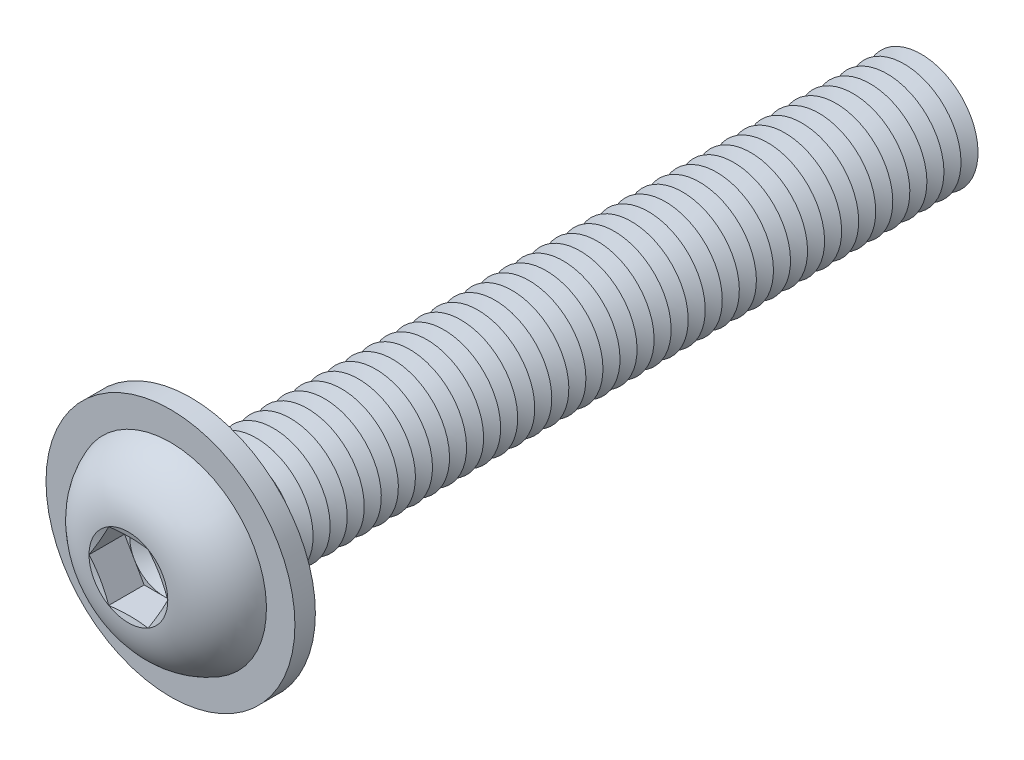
ISO-10303-21;
HEADER;
FILE_DESCRIPTION(('STEP AP214'),'2;1');
FILE_NAME('part.step','',(''),(''),'','','');
FILE_SCHEMA(('AUTOMOTIVE_DESIGN { 1 0 10303 214 1 1 1 1 }'));
ENDSEC;
DATA;
#1=APPLICATION_CONTEXT('core data for automotive mechanical design processes');
#2=APPLICATION_PROTOCOL_DEFINITION('international standard','automotive_design',2000,#1);
#3=PRODUCT_CONTEXT('',#1,'mechanical');
#4=PRODUCT('Part','Part','',(#3));
#5=PRODUCT_RELATED_PRODUCT_CATEGORY('part','',(#4));
#6=PRODUCT_DEFINITION_FORMATION('','',#4);
#7=PRODUCT_DEFINITION_CONTEXT('part definition',#1,'design');
#8=PRODUCT_DEFINITION('design','',#6,#7);
#9=PRODUCT_DEFINITION_SHAPE('','',#8);
#10=(LENGTH_UNIT() NAMED_UNIT(*) SI_UNIT(.MILLI.,.METRE.));
#11=(NAMED_UNIT(*) PLANE_ANGLE_UNIT() SI_UNIT($,.RADIAN.));
#12=(NAMED_UNIT(*) SI_UNIT($,.STERADIAN.) SOLID_ANGLE_UNIT());
#13=UNCERTAINTY_MEASURE_WITH_UNIT(LENGTH_MEASURE(1.E-05),#10,'distance_accuracy_value','');
#14=(GEOMETRIC_REPRESENTATION_CONTEXT(3) GLOBAL_UNCERTAINTY_ASSIGNED_CONTEXT((#13)) GLOBAL_UNIT_ASSIGNED_CONTEXT((#10,
#11,#12)) REPRESENTATION_CONTEXT('',''));
#15=CARTESIAN_POINT('',(0.,0.,0.));
#16=DIRECTION('',(0.,0.,1.));
#17=DIRECTION('',(1.,0.,0.));
#18=AXIS2_PLACEMENT_3D('',#15,#16,#17);
#19=CARTESIAN_POINT('',(0.,0.,-59.75));
#20=DIRECTION('',(0.,0.,1.));
#21=DIRECTION('',(0.,-1.,0.));
#22=AXIS2_PLACEMENT_3D('',#19,#20,#21);
#23=CONICAL_SURFACE('',#22,4.99999999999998,1.0471975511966);
#24=CARTESIAN_POINT('',(0.,0.,-60.5));
#25=DIRECTION('',(0.,0.,1.));
#26=DIRECTION('',(0.,-1.,0.));
#27=AXIS2_PLACEMENT_3D('',#24,#25,#26);
#28=CIRCLE('',#27,3.70096189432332);
#29=CARTESIAN_POINT('',(0.,-3.70096189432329,-60.5));
#30=VERTEX_POINT('',#29);
#31=EDGE_CURVE('E426',#30,#30,#28,.T.);
#32=ORIENTED_EDGE('',*,*,#31,.T.);
#33=EDGE_LOOP('',(#32));
#34=FACE_BOUND('',#33,.T.);
#35=CARTESIAN_POINT('',(0.,0.,-59.75));
#36=DIRECTION('',(0.,0.,1.));
#37=DIRECTION('',(0.,-1.,0.));
#38=AXIS2_PLACEMENT_3D('',#35,#36,#37);
#39=CIRCLE('',#38,4.99999999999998);
#40=CARTESIAN_POINT('',(0.,-4.99999999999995,-59.75));
#41=VERTEX_POINT('',#40);
#42=EDGE_CURVE('E422',#41,#41,#39,.T.);
#43=ORIENTED_EDGE('',*,*,#42,.F.);
#44=EDGE_LOOP('',(#43));
#45=FACE_BOUND('',#44,.T.);
#46=ADVANCED_FACE('F39',(#34,#45),#23,.T.);
#47=CARTESIAN_POINT('',(0.,0.,-60.5));
#48=DIRECTION('',(0.,0.,-1.));
#49=DIRECTION('',(0.,1.,0.));
#50=AXIS2_PLACEMENT_3D('',#47,#48,#49);
#51=CONICAL_SURFACE('',#50,3.70096189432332,1.0471975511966);
#52=CARTESIAN_POINT('',(0.,0.,-61.25));
#53=DIRECTION('',(0.,0.,1.));
#54=DIRECTION('',(0.,-1.,0.));
#55=AXIS2_PLACEMENT_3D('',#52,#53,#54);
#56=CIRCLE('',#55,4.99999999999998);
#57=CARTESIAN_POINT('',(0.,-4.99999999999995,-61.25));
#58=VERTEX_POINT('',#57);
#59=EDGE_CURVE('E430',#58,#58,#56,.T.);
#60=ORIENTED_EDGE('',*,*,#59,.T.);
#61=EDGE_LOOP('',(#60));
#62=FACE_BOUND('',#61,.T.);
#63=ORIENTED_EDGE('',*,*,#31,.F.);
#64=EDGE_LOOP('',(#63));
#65=FACE_BOUND('',#64,.T.);
#66=ADVANCED_FACE('F457',(#62,#65),#51,.T.);
#67=CARTESIAN_POINT('',(0.,4.99999999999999,-65.));
#68=DIRECTION('',(0.,0.,-1.));
#69=DIRECTION('',(0.,1.,0.));
#70=AXIS2_PLACEMENT_3D('',#67,#68,#69);
#71=PLANE('',#70);
#72=CARTESIAN_POINT('',(0.,0.,-65.));
#73=DIRECTION('',(0.,0.,1.));
#74=DIRECTION('',(0.,-1.,0.));
#75=AXIS2_PLACEMENT_3D('',#72,#73,#74);
#76=CIRCLE('',#75,3.70096189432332);
#77=CARTESIAN_POINT('',(0.,-3.70096189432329,-65.));
#78=VERTEX_POINT('',#77);
#79=EDGE_CURVE('E324',#78,#78,#76,.T.);
#80=ORIENTED_EDGE('',*,*,#79,.F.);
#81=EDGE_LOOP('',(#80));
#82=FACE_BOUND('',#81,.T.);
#83=ADVANCED_FACE('F455',(#82),#71,.T.);
#84=CARTESIAN_POINT('',(0.,0.,-64.25));
#85=DIRECTION('',(0.,0.,1.));
#86=DIRECTION('',(0.,-1.,0.));
#87=AXIS2_PLACEMENT_3D('',#84,#85,#86);
#88=CONICAL_SURFACE('',#87,4.99999999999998,1.0471975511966);
#89=ORIENTED_EDGE('',*,*,#79,.T.);
#90=EDGE_LOOP('',(#89));
#91=FACE_BOUND('',#90,.T.);
#92=CARTESIAN_POINT('',(0.,0.,-64.25));
#93=DIRECTION('',(0.,0.,1.));
#94=DIRECTION('',(0.,-1.,0.));
#95=AXIS2_PLACEMENT_3D('',#92,#93,#94);
#96=CIRCLE('',#95,4.99999999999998);
#97=CARTESIAN_POINT('',(0.,-4.99999999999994,-64.25));
#98=VERTEX_POINT('',#97);
#99=EDGE_CURVE('E444',#98,#98,#96,.T.);
#100=ORIENTED_EDGE('',*,*,#99,.F.);
#101=EDGE_LOOP('',(#100));
#102=FACE_BOUND('',#101,.T.);
#103=ADVANCED_FACE('F452',(#91,#102),#88,.T.);
#104=CARTESIAN_POINT('',(0.,0.,-63.5));
#105=DIRECTION('',(0.,0.,-1.));
#106=DIRECTION('',(0.,1.,0.));
#107=AXIS2_PLACEMENT_3D('',#104,#105,#106);
#108=CONICAL_SURFACE('',#107,3.70096189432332,1.0471975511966);
#109=ORIENTED_EDGE('',*,*,#99,.T.);
#110=EDGE_LOOP('',(#109));
#111=FACE_BOUND('',#110,.T.);
#112=CARTESIAN_POINT('',(0.,0.,-63.5));
#113=DIRECTION('',(0.,0.,1.));
#114=DIRECTION('',(0.,-1.,0.));
#115=AXIS2_PLACEMENT_3D('',#112,#113,#114);
#116=CIRCLE('',#115,3.70096189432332);
#117=CARTESIAN_POINT('',(0.,-3.70096189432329,-63.5));
#118=VERTEX_POINT('',#117);
#119=EDGE_CURVE('E440',#118,#118,#116,.T.);
#120=ORIENTED_EDGE('',*,*,#119,.F.);
#121=EDGE_LOOP('',(#120));
#122=FACE_BOUND('',#121,.T.);
#123=ADVANCED_FACE('F462',(#111,#122),#108,.T.);
#124=CARTESIAN_POINT('',(0.,0.,-62.75));
#125=DIRECTION('',(0.,0.,1.));
#126=DIRECTION('',(0.,-1.,0.));
#127=AXIS2_PLACEMENT_3D('',#124,#125,#126);
#128=CONICAL_SURFACE('',#127,4.99999999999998,1.0471975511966);
#129=ORIENTED_EDGE('',*,*,#119,.T.);
#130=EDGE_LOOP('',(#129));
#131=FACE_BOUND('',#130,.T.);
#132=CARTESIAN_POINT('',(0.,0.,-62.75));
#133=DIRECTION('',(0.,0.,1.));
#134=DIRECTION('',(0.,-1.,0.));
#135=AXIS2_PLACEMENT_3D('',#132,#133,#134);
#136=CIRCLE('',#135,4.99999999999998);
#137=CARTESIAN_POINT('',(0.,-4.99999999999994,-62.75));
#138=VERTEX_POINT('',#137);
#139=EDGE_CURVE('E437',#138,#138,#136,.T.);
#140=ORIENTED_EDGE('',*,*,#139,.F.);
#141=EDGE_LOOP('',(#140));
#142=FACE_BOUND('',#141,.T.);
#143=ADVANCED_FACE('F478',(#131,#142),#128,.T.);
#144=CARTESIAN_POINT('',(0.,0.,-62.));
#145=DIRECTION('',(0.,0.,-1.));
#146=DIRECTION('',(0.,1.,0.));
#147=AXIS2_PLACEMENT_3D('',#144,#145,#146);
#148=CONICAL_SURFACE('',#147,3.70096189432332,1.0471975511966);
#149=ORIENTED_EDGE('',*,*,#139,.T.);
#150=EDGE_LOOP('',(#149));
#151=FACE_BOUND('',#150,.T.);
#152=CARTESIAN_POINT('',(0.,0.,-62.));
#153=DIRECTION('',(0.,0.,1.));
#154=DIRECTION('',(0.,-1.,0.));
#155=AXIS2_PLACEMENT_3D('',#152,#153,#154);
#156=CIRCLE('',#155,3.70096189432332);
#157=CARTESIAN_POINT('',(0.,-3.70096189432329,-62.));
#158=VERTEX_POINT('',#157);
#159=EDGE_CURVE('E434',#158,#158,#156,.T.);
#160=ORIENTED_EDGE('',*,*,#159,.F.);
#161=EDGE_LOOP('',(#160));
#162=FACE_BOUND('',#161,.T.);
#163=ADVANCED_FACE('F474',(#151,#162),#148,.T.);
#164=CARTESIAN_POINT('',(0.,0.,-61.25));
#165=DIRECTION('',(0.,0.,1.));
#166=DIRECTION('',(0.,-1.,0.));
#167=AXIS2_PLACEMENT_3D('',#164,#165,#166);
#168=CONICAL_SURFACE('',#167,4.99999999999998,1.0471975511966);
#169=ORIENTED_EDGE('',*,*,#159,.T.);
#170=EDGE_LOOP('',(#169));
#171=FACE_BOUND('',#170,.T.);
#172=ORIENTED_EDGE('',*,*,#59,.F.);
#173=EDGE_LOOP('',(#172));
#174=FACE_BOUND('',#173,.T.);
#175=ADVANCED_FACE('F477',(#171,#174),#168,.T.);
#176=CARTESIAN_POINT('',(0.,0.,-58.25));
#177=DIRECTION('',(0.,0.,1.));
#178=DIRECTION('',(0.,-1.,0.));
#179=AXIS2_PLACEMENT_3D('',#176,#177,#178);
#180=CONICAL_SURFACE('',#179,4.99999999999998,1.0471975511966);
#181=CARTESIAN_POINT('',(0.,0.,-59.));
#182=DIRECTION('',(0.,0.,1.));
#183=DIRECTION('',(0.,-1.,0.));
#184=AXIS2_PLACEMENT_3D('',#181,#182,#183);
#185=CIRCLE('',#184,3.70096189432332);
#186=CARTESIAN_POINT('',(0.,-3.70096189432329,-59.));
#187=VERTEX_POINT('',#186);
#188=EDGE_CURVE('E418',#187,#187,#185,.T.);
#189=ORIENTED_EDGE('',*,*,#188,.T.);
#190=EDGE_LOOP('',(#189));
#191=FACE_BOUND('',#190,.T.);
#192=CARTESIAN_POINT('',(0.,0.,-58.25));
#193=DIRECTION('',(0.,0.,1.));
#194=DIRECTION('',(0.,-1.,0.));
#195=AXIS2_PLACEMENT_3D('',#192,#193,#194);
#196=CIRCLE('',#195,4.99999999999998);
#197=CARTESIAN_POINT('',(0.,-4.99999999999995,-58.25));
#198=VERTEX_POINT('',#197);
#199=EDGE_CURVE('E414',#198,#198,#196,.T.);
#200=ORIENTED_EDGE('',*,*,#199,.F.);
#201=EDGE_LOOP('',(#200));
#202=FACE_BOUND('',#201,.T.);
#203=ADVANCED_FACE('F482',(#191,#202),#180,.T.);
#204=CARTESIAN_POINT('',(0.,0.,-59.));
#205=DIRECTION('',(0.,0.,-1.));
#206=DIRECTION('',(0.,1.,0.));
#207=AXIS2_PLACEMENT_3D('',#204,#205,#206);
#208=CONICAL_SURFACE('',#207,3.70096189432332,1.0471975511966);
#209=ORIENTED_EDGE('',*,*,#42,.T.);
#210=EDGE_LOOP('',(#209));
#211=FACE_BOUND('',#210,.T.);
#212=ORIENTED_EDGE('',*,*,#188,.F.);
#213=EDGE_LOOP('',(#212));
#214=FACE_BOUND('',#213,.T.);
#215=ADVANCED_FACE('F514',(#211,#214),#208,.T.);
#216=CARTESIAN_POINT('',(0.,0.,-56.75));
#217=DIRECTION('',(0.,0.,1.));
#218=DIRECTION('',(0.,-1.,0.));
#219=AXIS2_PLACEMENT_3D('',#216,#217,#218);
#220=CONICAL_SURFACE('',#219,4.99999999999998,1.0471975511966);
#221=CARTESIAN_POINT('',(0.,0.,-57.5));
#222=DIRECTION('',(0.,0.,1.));
#223=DIRECTION('',(0.,-1.,0.));
#224=AXIS2_PLACEMENT_3D('',#221,#222,#223);
#225=CIRCLE('',#224,3.70096189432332);
#226=CARTESIAN_POINT('',(0.,-3.70096189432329,-57.5));
#227=VERTEX_POINT('',#226);
#228=EDGE_CURVE('E407',#227,#227,#225,.T.);
#229=ORIENTED_EDGE('',*,*,#228,.T.);
#230=EDGE_LOOP('',(#229));
#231=FACE_BOUND('',#230,.T.);
#232=CARTESIAN_POINT('',(0.,0.,-56.75));
#233=DIRECTION('',(0.,0.,1.));
#234=DIRECTION('',(0.,-1.,0.));
#235=AXIS2_PLACEMENT_3D('',#232,#233,#234);
#236=CIRCLE('',#235,4.99999999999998);
#237=CARTESIAN_POINT('',(0.,-4.99999999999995,-56.75));
#238=VERTEX_POINT('',#237);
#239=EDGE_CURVE('E401',#238,#238,#236,.T.);
#240=ORIENTED_EDGE('',*,*,#239,.F.);
#241=EDGE_LOOP('',(#240));
#242=FACE_BOUND('',#241,.T.);
#243=ADVANCED_FACE('F520',(#231,#242),#220,.T.);
#244=CARTESIAN_POINT('',(0.,0.,-57.5));
#245=DIRECTION('',(0.,0.,-1.));
#246=DIRECTION('',(0.,1.,0.));
#247=AXIS2_PLACEMENT_3D('',#244,#245,#246);
#248=CONICAL_SURFACE('',#247,3.70096189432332,1.0471975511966);
#249=ORIENTED_EDGE('',*,*,#199,.T.);
#250=EDGE_LOOP('',(#249));
#251=FACE_BOUND('',#250,.T.);
#252=ORIENTED_EDGE('',*,*,#228,.F.);
#253=EDGE_LOOP('',(#252));
#254=FACE_BOUND('',#253,.T.);
#255=ADVANCED_FACE('F527',(#251,#254),#248,.T.);
#256=CARTESIAN_POINT('',(0.,0.,-55.25));
#257=DIRECTION('',(0.,0.,1.));
#258=DIRECTION('',(0.,-1.,0.));
#259=AXIS2_PLACEMENT_3D('',#256,#257,#258);
#260=CONICAL_SURFACE('',#259,4.99999999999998,1.0471975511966);
#261=CARTESIAN_POINT('',(0.,0.,-56.));
#262=DIRECTION('',(0.,0.,1.));
#263=DIRECTION('',(0.,-1.,0.));
#264=AXIS2_PLACEMENT_3D('',#261,#262,#263);
#265=CIRCLE('',#264,3.70096189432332);
#266=CARTESIAN_POINT('',(0.,-3.70096189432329,-56.));
#267=VERTEX_POINT('',#266);
#268=EDGE_CURVE('E381',#267,#267,#265,.T.);
#269=ORIENTED_EDGE('',*,*,#268,.T.);
#270=EDGE_LOOP('',(#269));
#271=FACE_BOUND('',#270,.T.);
#272=CARTESIAN_POINT('',(0.,0.,-55.25));
#273=DIRECTION('',(0.,0.,1.));
#274=DIRECTION('',(0.,-1.,0.));
#275=AXIS2_PLACEMENT_3D('',#272,#273,#274);
#276=CIRCLE('',#275,4.99999999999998);
#277=CARTESIAN_POINT('',(0.,-4.99999999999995,-55.25));
#278=VERTEX_POINT('',#277);
#279=EDGE_CURVE('E379',#278,#278,#276,.T.);
#280=ORIENTED_EDGE('',*,*,#279,.F.);
#281=EDGE_LOOP('',(#280));
#282=FACE_BOUND('',#281,.T.);
#283=ADVANCED_FACE('F534',(#271,#282),#260,.T.);
#284=CARTESIAN_POINT('',(0.,0.,-56.));
#285=DIRECTION('',(0.,0.,-1.));
#286=DIRECTION('',(0.,1.,0.));
#287=AXIS2_PLACEMENT_3D('',#284,#285,#286);
#288=CONICAL_SURFACE('',#287,3.70096189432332,1.0471975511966);
#289=ORIENTED_EDGE('',*,*,#239,.T.);
#290=EDGE_LOOP('',(#289));
#291=FACE_BOUND('',#290,.T.);
#292=ORIENTED_EDGE('',*,*,#268,.F.);
#293=EDGE_LOOP('',(#292));
#294=FACE_BOUND('',#293,.T.);
#295=ADVANCED_FACE('F541',(#291,#294),#288,.T.);
#296=CARTESIAN_POINT('',(0.,0.,-53.75));
#297=DIRECTION('',(0.,0.,1.));
#298=DIRECTION('',(0.,-1.,0.));
#299=AXIS2_PLACEMENT_3D('',#296,#297,#298);
#300=CONICAL_SURFACE('',#299,4.99999999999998,1.0471975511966);
#301=CARTESIAN_POINT('',(0.,0.,-54.5));
#302=DIRECTION('',(0.,0.,1.));
#303=DIRECTION('',(0.,-1.,0.));
#304=AXIS2_PLACEMENT_3D('',#301,#302,#303);
#305=CIRCLE('',#304,3.70096189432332);
#306=CARTESIAN_POINT('',(0.,-3.70096189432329,-54.5));
#307=VERTEX_POINT('',#306);
#308=EDGE_CURVE('E382',#307,#307,#305,.T.);
#309=ORIENTED_EDGE('',*,*,#308,.T.);
#310=EDGE_LOOP('',(#309));
#311=FACE_BOUND('',#310,.T.);
#312=CARTESIAN_POINT('',(0.,0.,-53.75));
#313=DIRECTION('',(0.,0.,1.));
#314=DIRECTION('',(0.,-1.,0.));
#315=AXIS2_PLACEMENT_3D('',#312,#313,#314);
#316=CIRCLE('',#315,4.99999999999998);
#317=CARTESIAN_POINT('',(0.,-4.99999999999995,-53.75));
#318=VERTEX_POINT('',#317);
#319=EDGE_CURVE('E1706',#318,#318,#316,.T.);
#320=ORIENTED_EDGE('',*,*,#319,.F.);
#321=EDGE_LOOP('',(#320));
#322=FACE_BOUND('',#321,.T.);
#323=ADVANCED_FACE('F547',(#311,#322),#300,.T.);
#324=CARTESIAN_POINT('',(0.,0.,-54.5));
#325=DIRECTION('',(0.,0.,-1.));
#326=DIRECTION('',(0.,1.,0.));
#327=AXIS2_PLACEMENT_3D('',#324,#325,#326);
#328=CONICAL_SURFACE('',#327,3.70096189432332,1.0471975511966);
#329=ORIENTED_EDGE('',*,*,#279,.T.);
#330=EDGE_LOOP('',(#329));
#331=FACE_BOUND('',#330,.T.);
#332=ORIENTED_EDGE('',*,*,#308,.F.);
#333=EDGE_LOOP('',(#332));
#334=FACE_BOUND('',#333,.T.);
#335=ADVANCED_FACE('F554',(#331,#334),#328,.T.);
#336=CARTESIAN_POINT('',(0.,0.,-52.25));
#337=DIRECTION('',(0.,0.,1.));
#338=DIRECTION('',(0.,-1.,0.));
#339=AXIS2_PLACEMENT_3D('',#336,#337,#338);
#340=CONICAL_SURFACE('',#339,4.99999999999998,1.0471975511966);
#341=CARTESIAN_POINT('',(0.,0.,-53.));
#342=DIRECTION('',(0.,0.,1.));
#343=DIRECTION('',(0.,-1.,0.));
#344=AXIS2_PLACEMENT_3D('',#341,#342,#343);
#345=CIRCLE('',#344,3.70096189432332);
#346=CARTESIAN_POINT('',(0.,-3.70096189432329,-53.));
#347=VERTEX_POINT('',#346);
#348=EDGE_CURVE('E1745',#347,#347,#345,.T.);
#349=ORIENTED_EDGE('',*,*,#348,.T.);
#350=EDGE_LOOP('',(#349));
#351=FACE_BOUND('',#350,.T.);
#352=CARTESIAN_POINT('',(0.,0.,-52.25));
#353=DIRECTION('',(0.,0.,1.));
#354=DIRECTION('',(0.,-1.,0.));
#355=AXIS2_PLACEMENT_3D('',#352,#353,#354);
#356=CIRCLE('',#355,4.99999999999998);
#357=CARTESIAN_POINT('',(0.,-4.99999999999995,-52.25));
#358=VERTEX_POINT('',#357);
#359=EDGE_CURVE('E1743',#358,#358,#356,.T.);
#360=ORIENTED_EDGE('',*,*,#359,.F.);
#361=EDGE_LOOP('',(#360));
#362=FACE_BOUND('',#361,.T.);
#363=ADVANCED_FACE('F561',(#351,#362),#340,.T.);
#364=CARTESIAN_POINT('',(0.,0.,-53.));
#365=DIRECTION('',(0.,0.,-1.));
#366=DIRECTION('',(0.,1.,0.));
#367=AXIS2_PLACEMENT_3D('',#364,#365,#366);
#368=CONICAL_SURFACE('',#367,3.70096189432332,1.0471975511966);
#369=ORIENTED_EDGE('',*,*,#319,.T.);
#370=EDGE_LOOP('',(#369));
#371=FACE_BOUND('',#370,.T.);
#372=ORIENTED_EDGE('',*,*,#348,.F.);
#373=EDGE_LOOP('',(#372));
#374=FACE_BOUND('',#373,.T.);
#375=ADVANCED_FACE('F568',(#371,#374),#368,.T.);
#376=CARTESIAN_POINT('',(0.,0.,-50.75));
#377=DIRECTION('',(0.,0.,1.));
#378=DIRECTION('',(0.,-1.,0.));
#379=AXIS2_PLACEMENT_3D('',#376,#377,#378);
#380=CONICAL_SURFACE('',#379,4.99999999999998,1.0471975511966);
#381=CARTESIAN_POINT('',(0.,0.,-51.5));
#382=DIRECTION('',(0.,0.,1.));
#383=DIRECTION('',(0.,-1.,0.));
#384=AXIS2_PLACEMENT_3D('',#381,#382,#383);
#385=CIRCLE('',#384,3.70096189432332);
#386=CARTESIAN_POINT('',(0.,-3.70096189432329,-51.5));
#387=VERTEX_POINT('',#386);
#388=EDGE_CURVE('E1746',#387,#387,#385,.T.);
#389=ORIENTED_EDGE('',*,*,#388,.T.);
#390=EDGE_LOOP('',(#389));
#391=FACE_BOUND('',#390,.T.);
#392=CARTESIAN_POINT('',(0.,0.,-50.75));
#393=DIRECTION('',(0.,0.,1.));
#394=DIRECTION('',(0.,-1.,0.));
#395=AXIS2_PLACEMENT_3D('',#392,#393,#394);
#396=CIRCLE('',#395,4.99999999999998);
#397=CARTESIAN_POINT('',(0.,-4.99999999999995,-50.75));
#398=VERTEX_POINT('',#397);
#399=EDGE_CURVE('E1703',#398,#398,#396,.T.);
#400=ORIENTED_EDGE('',*,*,#399,.F.);
#401=EDGE_LOOP('',(#400));
#402=FACE_BOUND('',#401,.T.);
#403=ADVANCED_FACE('F575',(#391,#402),#380,.T.);
#404=CARTESIAN_POINT('',(0.,0.,-51.5));
#405=DIRECTION('',(0.,0.,-1.));
#406=DIRECTION('',(0.,1.,0.));
#407=AXIS2_PLACEMENT_3D('',#404,#405,#406);
#408=CONICAL_SURFACE('',#407,3.70096189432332,1.0471975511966);
#409=ORIENTED_EDGE('',*,*,#359,.T.);
#410=EDGE_LOOP('',(#409));
#411=FACE_BOUND('',#410,.T.);
#412=ORIENTED_EDGE('',*,*,#388,.F.);
#413=EDGE_LOOP('',(#412));
#414=FACE_BOUND('',#413,.T.);
#415=ADVANCED_FACE('F582',(#411,#414),#408,.T.);
#416=CARTESIAN_POINT('',(0.,0.,-49.25));
#417=DIRECTION('',(0.,0.,1.));
#418=DIRECTION('',(0.,-1.,0.));
#419=AXIS2_PLACEMENT_3D('',#416,#417,#418);
#420=CONICAL_SURFACE('',#419,4.99999999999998,1.0471975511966);
#421=CARTESIAN_POINT('',(0.,0.,-50.));
#422=DIRECTION('',(0.,0.,1.));
#423=DIRECTION('',(0.,-1.,0.));
#424=AXIS2_PLACEMENT_3D('',#421,#422,#423);
#425=CIRCLE('',#424,3.70096189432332);
#426=CARTESIAN_POINT('',(0.,-3.70096189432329,-50.));
#427=VERTEX_POINT('',#426);
#428=EDGE_CURVE('E376',#427,#427,#425,.T.);
#429=ORIENTED_EDGE('',*,*,#428,.T.);
#430=EDGE_LOOP('',(#429));
#431=FACE_BOUND('',#430,.T.);
#432=CARTESIAN_POINT('',(0.,0.,-49.25));
#433=DIRECTION('',(0.,0.,1.));
#434=DIRECTION('',(0.,-1.,0.));
#435=AXIS2_PLACEMENT_3D('',#432,#433,#434);
#436=CIRCLE('',#435,4.99999999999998);
#437=CARTESIAN_POINT('',(0.,-4.99999999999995,-49.25));
#438=VERTEX_POINT('',#437);
#439=EDGE_CURVE('E373',#438,#438,#436,.T.);
#440=ORIENTED_EDGE('',*,*,#439,.F.);
#441=EDGE_LOOP('',(#440));
#442=FACE_BOUND('',#441,.T.);
#443=ADVANCED_FACE('F589',(#431,#442),#420,.T.);
#444=CARTESIAN_POINT('',(0.,0.,-50.));
#445=DIRECTION('',(0.,0.,-1.));
#446=DIRECTION('',(0.,1.,0.));
#447=AXIS2_PLACEMENT_3D('',#444,#445,#446);
#448=CONICAL_SURFACE('',#447,3.70096189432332,1.0471975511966);
#449=ORIENTED_EDGE('',*,*,#399,.T.);
#450=EDGE_LOOP('',(#449));
#451=FACE_BOUND('',#450,.T.);
#452=ORIENTED_EDGE('',*,*,#428,.F.);
#453=EDGE_LOOP('',(#452));
#454=FACE_BOUND('',#453,.T.);
#455=ADVANCED_FACE('F596',(#451,#454),#448,.T.);
#456=CARTESIAN_POINT('',(0.,0.,-47.75));
#457=DIRECTION('',(0.,0.,1.));
#458=DIRECTION('',(0.,-1.,0.));
#459=AXIS2_PLACEMENT_3D('',#456,#457,#458);
#460=CONICAL_SURFACE('',#459,4.99999999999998,1.0471975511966);
#461=CARTESIAN_POINT('',(0.,0.,-48.5));
#462=DIRECTION('',(0.,0.,1.));
#463=DIRECTION('',(0.,-1.,0.));
#464=AXIS2_PLACEMENT_3D('',#461,#462,#463);
#465=CIRCLE('',#464,3.70096189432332);
#466=CARTESIAN_POINT('',(0.,-3.70096189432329,-48.5));
#467=VERTEX_POINT('',#466);
#468=EDGE_CURVE('E377',#467,#467,#465,.T.);
#469=ORIENTED_EDGE('',*,*,#468,.T.);
#470=EDGE_LOOP('',(#469));
#471=FACE_BOUND('',#470,.T.);
#472=CARTESIAN_POINT('',(0.,0.,-47.75));
#473=DIRECTION('',(0.,0.,1.));
#474=DIRECTION('',(0.,-1.,0.));
#475=AXIS2_PLACEMENT_3D('',#472,#473,#474);
#476=CIRCLE('',#475,4.99999999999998);
#477=CARTESIAN_POINT('',(0.,-4.99999999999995,-47.75));
#478=VERTEX_POINT('',#477);
#479=EDGE_CURVE('E1682',#478,#478,#476,.T.);
#480=ORIENTED_EDGE('',*,*,#479,.F.);
#481=EDGE_LOOP('',(#480));
#482=FACE_BOUND('',#481,.T.);
#483=ADVANCED_FACE('F603',(#471,#482),#460,.T.);
#484=CARTESIAN_POINT('',(0.,0.,-48.5));
#485=DIRECTION('',(0.,0.,-1.));
#486=DIRECTION('',(0.,1.,0.));
#487=AXIS2_PLACEMENT_3D('',#484,#485,#486);
#488=CONICAL_SURFACE('',#487,3.70096189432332,1.0471975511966);
#489=ORIENTED_EDGE('',*,*,#439,.T.);
#490=EDGE_LOOP('',(#489));
#491=FACE_BOUND('',#490,.T.);
#492=ORIENTED_EDGE('',*,*,#468,.F.);
#493=EDGE_LOOP('',(#492));
#494=FACE_BOUND('',#493,.T.);
#495=ADVANCED_FACE('F610',(#491,#494),#488,.T.);
#496=CARTESIAN_POINT('',(0.,0.,-46.25));
#497=DIRECTION('',(0.,0.,1.));
#498=DIRECTION('',(0.,-1.,0.));
#499=AXIS2_PLACEMENT_3D('',#496,#497,#498);
#500=CONICAL_SURFACE('',#499,4.99999999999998,1.0471975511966);
#501=CARTESIAN_POINT('',(0.,0.,-47.));
#502=DIRECTION('',(0.,0.,1.));
#503=DIRECTION('',(0.,-1.,0.));
#504=AXIS2_PLACEMENT_3D('',#501,#502,#503);
#505=CIRCLE('',#504,3.70096189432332);
#506=CARTESIAN_POINT('',(0.,-3.70096189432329,-47.));
#507=VERTEX_POINT('',#506);
#508=EDGE_CURVE('E351',#507,#507,#505,.T.);
#509=ORIENTED_EDGE('',*,*,#508,.T.);
#510=EDGE_LOOP('',(#509));
#511=FACE_BOUND('',#510,.T.);
#512=CARTESIAN_POINT('',(0.,0.,-46.25));
#513=DIRECTION('',(0.,0.,1.));
#514=DIRECTION('',(0.,-1.,0.));
#515=AXIS2_PLACEMENT_3D('',#512,#513,#514);
#516=CIRCLE('',#515,4.99999999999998);
#517=CARTESIAN_POINT('',(0.,-4.99999999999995,-46.25));
#518=VERTEX_POINT('',#517);
#519=EDGE_CURVE('E349',#518,#518,#516,.T.);
#520=ORIENTED_EDGE('',*,*,#519,.F.);
#521=EDGE_LOOP('',(#520));
#522=FACE_BOUND('',#521,.T.);
#523=ADVANCED_FACE('F617',(#511,#522),#500,.T.);
#524=CARTESIAN_POINT('',(0.,0.,-47.));
#525=DIRECTION('',(0.,0.,-1.));
#526=DIRECTION('',(0.,1.,0.));
#527=AXIS2_PLACEMENT_3D('',#524,#525,#526);
#528=CONICAL_SURFACE('',#527,3.70096189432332,1.0471975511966);
#529=ORIENTED_EDGE('',*,*,#479,.T.);
#530=EDGE_LOOP('',(#529));
#531=FACE_BOUND('',#530,.T.);
#532=ORIENTED_EDGE('',*,*,#508,.F.);
#533=EDGE_LOOP('',(#532));
#534=FACE_BOUND('',#533,.T.);
#535=ADVANCED_FACE('F624',(#531,#534),#528,.T.);
#536=CARTESIAN_POINT('',(0.,0.,-44.75));
#537=DIRECTION('',(0.,0.,1.));
#538=DIRECTION('',(0.,-1.,0.));
#539=AXIS2_PLACEMENT_3D('',#536,#537,#538);
#540=CONICAL_SURFACE('',#539,4.99999999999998,1.0471975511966);
#541=CARTESIAN_POINT('',(0.,0.,-45.5));
#542=DIRECTION('',(0.,0.,1.));
#543=DIRECTION('',(0.,-1.,0.));
#544=AXIS2_PLACEMENT_3D('',#541,#542,#543);
#545=CIRCLE('',#544,3.70096189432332);
#546=CARTESIAN_POINT('',(0.,-3.70096189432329,-45.5));
#547=VERTEX_POINT('',#546);
#548=EDGE_CURVE('E352',#547,#547,#545,.T.);
#549=ORIENTED_EDGE('',*,*,#548,.T.);
#550=EDGE_LOOP('',(#549));
#551=FACE_BOUND('',#550,.T.);
#552=CARTESIAN_POINT('',(0.,0.,-44.75));
#553=DIRECTION('',(0.,0.,1.));
#554=DIRECTION('',(0.,-1.,0.));
#555=AXIS2_PLACEMENT_3D('',#552,#553,#554);
#556=CIRCLE('',#555,4.99999999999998);
#557=CARTESIAN_POINT('',(0.,-4.99999999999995,-44.75));
#558=VERTEX_POINT('',#557);
#559=EDGE_CURVE('E1654',#558,#558,#556,.T.);
#560=ORIENTED_EDGE('',*,*,#559,.F.);
#561=EDGE_LOOP('',(#560));
#562=FACE_BOUND('',#561,.T.);
#563=ADVANCED_FACE('F631',(#551,#562),#540,.T.);
#564=CARTESIAN_POINT('',(0.,0.,-45.5));
#565=DIRECTION('',(0.,0.,-1.));
#566=DIRECTION('',(0.,1.,0.));
#567=AXIS2_PLACEMENT_3D('',#564,#565,#566);
#568=CONICAL_SURFACE('',#567,3.70096189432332,1.0471975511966);
#569=ORIENTED_EDGE('',*,*,#519,.T.);
#570=EDGE_LOOP('',(#569));
#571=FACE_BOUND('',#570,.T.);
#572=ORIENTED_EDGE('',*,*,#548,.F.);
#573=EDGE_LOOP('',(#572));
#574=FACE_BOUND('',#573,.T.);
#575=ADVANCED_FACE('F638',(#571,#574),#568,.T.);
#576=CARTESIAN_POINT('',(0.,0.,-43.25));
#577=DIRECTION('',(0.,0.,1.));
#578=DIRECTION('',(0.,-1.,0.));
#579=AXIS2_PLACEMENT_3D('',#576,#577,#578);
#580=CONICAL_SURFACE('',#579,4.99999999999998,1.0471975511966);
#581=CARTESIAN_POINT('',(0.,0.,-44.));
#582=DIRECTION('',(0.,0.,1.));
#583=DIRECTION('',(0.,-1.,0.));
#584=AXIS2_PLACEMENT_3D('',#581,#582,#583);
#585=CIRCLE('',#584,3.70096189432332);
#586=CARTESIAN_POINT('',(0.,-3.70096189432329,-44.));
#587=VERTEX_POINT('',#586);
#588=EDGE_CURVE('E370',#587,#587,#585,.T.);
#589=ORIENTED_EDGE('',*,*,#588,.T.);
#590=EDGE_LOOP('',(#589));
#591=FACE_BOUND('',#590,.T.);
#592=CARTESIAN_POINT('',(0.,0.,-43.25));
#593=DIRECTION('',(0.,0.,1.));
#594=DIRECTION('',(0.,-1.,0.));
#595=AXIS2_PLACEMENT_3D('',#592,#593,#594);
#596=CIRCLE('',#595,4.99999999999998);
#597=CARTESIAN_POINT('',(0.,-4.99999999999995,-43.25));
#598=VERTEX_POINT('',#597);
#599=EDGE_CURVE('E367',#598,#598,#596,.T.);
#600=ORIENTED_EDGE('',*,*,#599,.F.);
#601=EDGE_LOOP('',(#600));
#602=FACE_BOUND('',#601,.T.);
#603=ADVANCED_FACE('F645',(#591,#602),#580,.T.);
#604=CARTESIAN_POINT('',(0.,0.,-44.));
#605=DIRECTION('',(0.,0.,-1.));
#606=DIRECTION('',(0.,1.,0.));
#607=AXIS2_PLACEMENT_3D('',#604,#605,#606);
#608=CONICAL_SURFACE('',#607,3.70096189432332,1.0471975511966);
#609=ORIENTED_EDGE('',*,*,#559,.T.);
#610=EDGE_LOOP('',(#609));
#611=FACE_BOUND('',#610,.T.);
#612=ORIENTED_EDGE('',*,*,#588,.F.);
#613=EDGE_LOOP('',(#612));
#614=FACE_BOUND('',#613,.T.);
#615=ADVANCED_FACE('F652',(#611,#614),#608,.T.);
#616=CARTESIAN_POINT('',(0.,0.,-41.75));
#617=DIRECTION('',(0.,0.,1.));
#618=DIRECTION('',(0.,-1.,0.));
#619=AXIS2_PLACEMENT_3D('',#616,#617,#618);
#620=CONICAL_SURFACE('',#619,4.99999999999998,1.0471975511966);
#621=CARTESIAN_POINT('',(0.,0.,-42.5));
#622=DIRECTION('',(0.,0.,1.));
#623=DIRECTION('',(0.,-1.,0.));
#624=AXIS2_PLACEMENT_3D('',#621,#622,#623);
#625=CIRCLE('',#624,3.70096189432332);
#626=CARTESIAN_POINT('',(0.,-3.7009618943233,-42.5));
#627=VERTEX_POINT('',#626);
#628=EDGE_CURVE('E371',#627,#627,#625,.T.);
#629=ORIENTED_EDGE('',*,*,#628,.T.);
#630=EDGE_LOOP('',(#629));
#631=FACE_BOUND('',#630,.T.);
#632=CARTESIAN_POINT('',(0.,0.,-41.75));
#633=DIRECTION('',(0.,0.,1.));
#634=DIRECTION('',(0.,-1.,0.));
#635=AXIS2_PLACEMENT_3D('',#632,#633,#634);
#636=CIRCLE('',#635,4.99999999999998);
#637=CARTESIAN_POINT('',(0.,-4.99999999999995,-41.75));
#638=VERTEX_POINT('',#637);
#639=EDGE_CURVE('E1676',#638,#638,#636,.T.);
#640=ORIENTED_EDGE('',*,*,#639,.F.);
#641=EDGE_LOOP('',(#640));
#642=FACE_BOUND('',#641,.T.);
#643=ADVANCED_FACE('F659',(#631,#642),#620,.T.);
#644=CARTESIAN_POINT('',(0.,0.,-42.5));
#645=DIRECTION('',(0.,0.,-1.));
#646=DIRECTION('',(0.,1.,0.));
#647=AXIS2_PLACEMENT_3D('',#644,#645,#646);
#648=CONICAL_SURFACE('',#647,3.70096189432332,1.0471975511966);
#649=ORIENTED_EDGE('',*,*,#599,.T.);
#650=EDGE_LOOP('',(#649));
#651=FACE_BOUND('',#650,.T.);
#652=ORIENTED_EDGE('',*,*,#628,.F.);
#653=EDGE_LOOP('',(#652));
#654=FACE_BOUND('',#653,.T.);
#655=ADVANCED_FACE('F666',(#651,#654),#648,.T.);
#656=CARTESIAN_POINT('',(0.,0.,-40.25));
#657=DIRECTION('',(0.,0.,1.));
#658=DIRECTION('',(0.,-1.,0.));
#659=AXIS2_PLACEMENT_3D('',#656,#657,#658);
#660=CONICAL_SURFACE('',#659,4.99999999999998,1.0471975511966);
#661=CARTESIAN_POINT('',(0.,0.,-41.));
#662=DIRECTION('',(0.,0.,1.));
#663=DIRECTION('',(0.,-1.,0.));
#664=AXIS2_PLACEMENT_3D('',#661,#662,#663);
#665=CIRCLE('',#664,3.70096189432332);
#666=CARTESIAN_POINT('',(0.,-3.7009618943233,-41.));
#667=VERTEX_POINT('',#666);
#668=EDGE_CURVE('E1673',#667,#667,#665,.T.);
#669=ORIENTED_EDGE('',*,*,#668,.T.);
#670=EDGE_LOOP('',(#669));
#671=FACE_BOUND('',#670,.T.);
#672=CARTESIAN_POINT('',(0.,0.,-40.25));
#673=DIRECTION('',(0.,0.,1.));
#674=DIRECTION('',(0.,-1.,0.));
#675=AXIS2_PLACEMENT_3D('',#672,#673,#674);
#676=CIRCLE('',#675,4.99999999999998);
#677=CARTESIAN_POINT('',(0.,-4.99999999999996,-40.25));
#678=VERTEX_POINT('',#677);
#679=EDGE_CURVE('E1677',#678,#678,#676,.T.);
#680=ORIENTED_EDGE('',*,*,#679,.F.);
#681=EDGE_LOOP('',(#680));
#682=FACE_BOUND('',#681,.T.);
#683=ADVANCED_FACE('F673',(#671,#682),#660,.T.);
#684=CARTESIAN_POINT('',(0.,0.,-41.));
#685=DIRECTION('',(0.,0.,-1.));
#686=DIRECTION('',(0.,1.,0.));
#687=AXIS2_PLACEMENT_3D('',#684,#685,#686);
#688=CONICAL_SURFACE('',#687,3.70096189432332,1.0471975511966);
#689=ORIENTED_EDGE('',*,*,#639,.T.);
#690=EDGE_LOOP('',(#689));
#691=FACE_BOUND('',#690,.T.);
#692=ORIENTED_EDGE('',*,*,#668,.F.);
#693=EDGE_LOOP('',(#692));
#694=FACE_BOUND('',#693,.T.);
#695=ADVANCED_FACE('F680',(#691,#694),#688,.T.);
#696=CARTESIAN_POINT('',(0.,0.,-38.75));
#697=DIRECTION('',(0.,0.,1.));
#698=DIRECTION('',(0.,-1.,0.));
#699=AXIS2_PLACEMENT_3D('',#696,#697,#698);
#700=CONICAL_SURFACE('',#699,4.99999999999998,1.0471975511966);
#701=CARTESIAN_POINT('',(0.,0.,-39.5));
#702=DIRECTION('',(0.,0.,1.));
#703=DIRECTION('',(0.,-1.,0.));
#704=AXIS2_PLACEMENT_3D('',#701,#702,#703);
#705=CIRCLE('',#704,3.70096189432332);
#706=CARTESIAN_POINT('',(0.,-3.7009618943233,-39.5));
#707=VERTEX_POINT('',#706);
#708=EDGE_CURVE('E398',#707,#707,#705,.T.);
#709=ORIENTED_EDGE('',*,*,#708,.T.);
#710=EDGE_LOOP('',(#709));
#711=FACE_BOUND('',#710,.T.);
#712=CARTESIAN_POINT('',(0.,0.,-38.75));
#713=DIRECTION('',(0.,0.,1.));
#714=DIRECTION('',(0.,-1.,0.));
#715=AXIS2_PLACEMENT_3D('',#712,#713,#714);
#716=CIRCLE('',#715,4.99999999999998);
#717=CARTESIAN_POINT('',(0.,-4.99999999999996,-38.75));
#718=VERTEX_POINT('',#717);
#719=EDGE_CURVE('E346',#718,#718,#716,.T.);
#720=ORIENTED_EDGE('',*,*,#719,.F.);
#721=EDGE_LOOP('',(#720));
#722=FACE_BOUND('',#721,.T.);
#723=ADVANCED_FACE('F687',(#711,#722),#700,.T.);
#724=CARTESIAN_POINT('',(0.,0.,-39.5));
#725=DIRECTION('',(0.,0.,-1.));
#726=DIRECTION('',(0.,1.,0.));
#727=AXIS2_PLACEMENT_3D('',#724,#725,#726);
#728=CONICAL_SURFACE('',#727,3.70096189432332,1.0471975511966);
#729=ORIENTED_EDGE('',*,*,#679,.T.);
#730=EDGE_LOOP('',(#729));
#731=FACE_BOUND('',#730,.T.);
#732=ORIENTED_EDGE('',*,*,#708,.F.);
#733=EDGE_LOOP('',(#732));
#734=FACE_BOUND('',#733,.T.);
#735=ADVANCED_FACE('F694',(#731,#734),#728,.T.);
#736=CARTESIAN_POINT('',(0.,0.,-37.25));
#737=DIRECTION('',(0.,0.,1.));
#738=DIRECTION('',(0.,-1.,0.));
#739=AXIS2_PLACEMENT_3D('',#736,#737,#738);
#740=CONICAL_SURFACE('',#739,4.99999999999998,1.0471975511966);
#741=CARTESIAN_POINT('',(0.,0.,-38.));
#742=DIRECTION('',(0.,0.,1.));
#743=DIRECTION('',(0.,-1.,0.));
#744=AXIS2_PLACEMENT_3D('',#741,#742,#743);
#745=CIRCLE('',#744,3.70096189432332);
#746=CARTESIAN_POINT('',(0.,-3.7009618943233,-38.));
#747=VERTEX_POINT('',#746);
#748=EDGE_CURVE('E343',#747,#747,#745,.T.);
#749=ORIENTED_EDGE('',*,*,#748,.T.);
#750=EDGE_LOOP('',(#749));
#751=FACE_BOUND('',#750,.T.);
#752=CARTESIAN_POINT('',(0.,0.,-37.25));
#753=DIRECTION('',(0.,0.,1.));
#754=DIRECTION('',(0.,-1.,0.));
#755=AXIS2_PLACEMENT_3D('',#752,#753,#754);
#756=CIRCLE('',#755,4.99999999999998);
#757=CARTESIAN_POINT('',(0.,-4.99999999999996,-37.25));
#758=VERTEX_POINT('',#757);
#759=EDGE_CURVE('E347',#758,#758,#756,.T.);
#760=ORIENTED_EDGE('',*,*,#759,.F.);
#761=EDGE_LOOP('',(#760));
#762=FACE_BOUND('',#761,.T.);
#763=ADVANCED_FACE('F701',(#751,#762),#740,.T.);
#764=CARTESIAN_POINT('',(0.,0.,-38.));
#765=DIRECTION('',(0.,0.,-1.));
#766=DIRECTION('',(0.,1.,0.));
#767=AXIS2_PLACEMENT_3D('',#764,#765,#766);
#768=CONICAL_SURFACE('',#767,3.70096189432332,1.0471975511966);
#769=ORIENTED_EDGE('',*,*,#719,.T.);
#770=EDGE_LOOP('',(#769));
#771=FACE_BOUND('',#770,.T.);
#772=ORIENTED_EDGE('',*,*,#748,.F.);
#773=EDGE_LOOP('',(#772));
#774=FACE_BOUND('',#773,.T.);
#775=ADVANCED_FACE('F708',(#771,#774),#768,.T.);
#776=CARTESIAN_POINT('',(0.,0.,-35.75));
#777=DIRECTION('',(0.,0.,1.));
#778=DIRECTION('',(0.,-1.,0.));
#779=AXIS2_PLACEMENT_3D('',#776,#777,#778);
#780=CONICAL_SURFACE('',#779,4.99999999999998,1.0471975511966);
#781=CARTESIAN_POINT('',(0.,0.,-36.5));
#782=DIRECTION('',(0.,0.,1.));
#783=DIRECTION('',(0.,-1.,0.));
#784=AXIS2_PLACEMENT_3D('',#781,#782,#783);
#785=CIRCLE('',#784,3.70096189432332);
#786=CARTESIAN_POINT('',(0.,-3.7009618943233,-36.5));
#787=VERTEX_POINT('',#786);
#788=EDGE_CURVE('E1741',#787,#787,#785,.T.);
#789=ORIENTED_EDGE('',*,*,#788,.T.);
#790=EDGE_LOOP('',(#789));
#791=FACE_BOUND('',#790,.T.);
#792=CARTESIAN_POINT('',(0.,0.,-35.75));
#793=DIRECTION('',(0.,0.,1.));
#794=DIRECTION('',(0.,-1.,0.));
#795=AXIS2_PLACEMENT_3D('',#792,#793,#794);
#796=CIRCLE('',#795,4.99999999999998);
#797=CARTESIAN_POINT('',(0.,-4.99999999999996,-35.75));
#798=VERTEX_POINT('',#797);
#799=EDGE_CURVE('E1824',#798,#798,#796,.T.);
#800=ORIENTED_EDGE('',*,*,#799,.F.);
#801=EDGE_LOOP('',(#800));
#802=FACE_BOUND('',#801,.T.);
#803=ADVANCED_FACE('F715',(#791,#802),#780,.T.);
#804=CARTESIAN_POINT('',(0.,0.,-36.5));
#805=DIRECTION('',(0.,0.,-1.));
#806=DIRECTION('',(0.,1.,0.));
#807=AXIS2_PLACEMENT_3D('',#804,#805,#806);
#808=CONICAL_SURFACE('',#807,3.70096189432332,1.0471975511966);
#809=ORIENTED_EDGE('',*,*,#759,.T.);
#810=EDGE_LOOP('',(#809));
#811=FACE_BOUND('',#810,.T.);
#812=ORIENTED_EDGE('',*,*,#788,.F.);
#813=EDGE_LOOP('',(#812));
#814=FACE_BOUND('',#813,.T.);
#815=ADVANCED_FACE('F722',(#811,#814),#808,.T.);
#816=CARTESIAN_POINT('',(0.,0.,-34.25));
#817=DIRECTION('',(0.,0.,1.));
#818=DIRECTION('',(0.,-1.,0.));
#819=AXIS2_PLACEMENT_3D('',#816,#817,#818);
#820=CONICAL_SURFACE('',#819,4.99999999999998,1.0471975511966);
#821=CARTESIAN_POINT('',(0.,0.,-35.));
#822=DIRECTION('',(0.,0.,1.));
#823=DIRECTION('',(0.,-1.,0.));
#824=AXIS2_PLACEMENT_3D('',#821,#822,#823);
#825=CIRCLE('',#824,3.70096189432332);
#826=CARTESIAN_POINT('',(0.,-3.7009618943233,-35.));
#827=VERTEX_POINT('',#826);
#828=EDGE_CURVE('E1820',#827,#827,#825,.T.);
#829=ORIENTED_EDGE('',*,*,#828,.T.);
#830=EDGE_LOOP('',(#829));
#831=FACE_BOUND('',#830,.T.);
#832=CARTESIAN_POINT('',(0.,0.,-34.25));
#833=DIRECTION('',(0.,0.,1.));
#834=DIRECTION('',(0.,-1.,0.));
#835=AXIS2_PLACEMENT_3D('',#832,#833,#834);
#836=CIRCLE('',#835,4.99999999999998);
#837=CARTESIAN_POINT('',(0.,-4.99999999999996,-34.25));
#838=VERTEX_POINT('',#837);
#839=EDGE_CURVE('E364',#838,#838,#836,.T.);
#840=ORIENTED_EDGE('',*,*,#839,.F.);
#841=EDGE_LOOP('',(#840));
#842=FACE_BOUND('',#841,.T.);
#843=ADVANCED_FACE('F729',(#831,#842),#820,.T.);
#844=CARTESIAN_POINT('',(0.,0.,-35.));
#845=DIRECTION('',(0.,0.,-1.));
#846=DIRECTION('',(0.,1.,0.));
#847=AXIS2_PLACEMENT_3D('',#844,#845,#846);
#848=CONICAL_SURFACE('',#847,3.70096189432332,1.0471975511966);
#849=ORIENTED_EDGE('',*,*,#799,.T.);
#850=EDGE_LOOP('',(#849));
#851=FACE_BOUND('',#850,.T.);
#852=ORIENTED_EDGE('',*,*,#828,.F.);
#853=EDGE_LOOP('',(#852));
#854=FACE_BOUND('',#853,.T.);
#855=ADVANCED_FACE('F736',(#851,#854),#848,.T.);
#856=CARTESIAN_POINT('',(0.,0.,-32.75));
#857=DIRECTION('',(0.,0.,1.));
#858=DIRECTION('',(0.,-1.,0.));
#859=AXIS2_PLACEMENT_3D('',#856,#857,#858);
#860=CONICAL_SURFACE('',#859,4.99999999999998,1.0471975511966);
#861=CARTESIAN_POINT('',(0.,0.,-33.5));
#862=DIRECTION('',(0.,0.,1.));
#863=DIRECTION('',(0.,-1.,0.));
#864=AXIS2_PLACEMENT_3D('',#861,#862,#863);
#865=CIRCLE('',#864,3.70096189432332);
#866=CARTESIAN_POINT('',(0.,-3.7009618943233,-33.5));
#867=VERTEX_POINT('',#866);
#868=EDGE_CURVE('E361',#867,#867,#865,.T.);
#869=ORIENTED_EDGE('',*,*,#868,.T.);
#870=EDGE_LOOP('',(#869));
#871=FACE_BOUND('',#870,.T.);
#872=CARTESIAN_POINT('',(0.,0.,-32.75));
#873=DIRECTION('',(0.,0.,1.));
#874=DIRECTION('',(0.,-1.,0.));
#875=AXIS2_PLACEMENT_3D('',#872,#873,#874);
#876=CIRCLE('',#875,4.99999999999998);
#877=CARTESIAN_POINT('',(0.,-4.99999999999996,-32.75));
#878=VERTEX_POINT('',#877);
#879=EDGE_CURVE('E365',#878,#878,#876,.T.);
#880=ORIENTED_EDGE('',*,*,#879,.F.);
#881=EDGE_LOOP('',(#880));
#882=FACE_BOUND('',#881,.T.);
#883=ADVANCED_FACE('F743',(#871,#882),#860,.T.);
#884=CARTESIAN_POINT('',(0.,0.,-33.5));
#885=DIRECTION('',(0.,0.,-1.));
#886=DIRECTION('',(0.,1.,0.));
#887=AXIS2_PLACEMENT_3D('',#884,#885,#886);
#888=CONICAL_SURFACE('',#887,3.70096189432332,1.0471975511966);
#889=ORIENTED_EDGE('',*,*,#839,.T.);
#890=EDGE_LOOP('',(#889));
#891=FACE_BOUND('',#890,.T.);
#892=ORIENTED_EDGE('',*,*,#868,.F.);
#893=EDGE_LOOP('',(#892));
#894=FACE_BOUND('',#893,.T.);
#895=ADVANCED_FACE('F750',(#891,#894),#888,.T.);
#896=CARTESIAN_POINT('',(0.,0.,-31.25));
#897=DIRECTION('',(0.,0.,1.));
#898=DIRECTION('',(0.,-1.,0.));
#899=AXIS2_PLACEMENT_3D('',#896,#897,#898);
#900=CONICAL_SURFACE('',#899,4.99999999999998,1.0471975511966);
#901=CARTESIAN_POINT('',(0.,0.,-32.));
#902=DIRECTION('',(0.,0.,1.));
#903=DIRECTION('',(0.,-1.,0.));
#904=AXIS2_PLACEMENT_3D('',#901,#902,#903);
#905=CIRCLE('',#904,3.70096189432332);
#906=CARTESIAN_POINT('',(0.,-3.7009618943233,-32.));
#907=VERTEX_POINT('',#906);
#908=EDGE_CURVE('E1753',#907,#907,#905,.T.);
#909=ORIENTED_EDGE('',*,*,#908,.T.);
#910=EDGE_LOOP('',(#909));
#911=FACE_BOUND('',#910,.T.);
#912=CARTESIAN_POINT('',(0.,0.,-31.25));
#913=DIRECTION('',(0.,0.,1.));
#914=DIRECTION('',(0.,-1.,0.));
#915=AXIS2_PLACEMENT_3D('',#912,#913,#914);
#916=CIRCLE('',#915,4.99999999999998);
#917=CARTESIAN_POINT('',(0.,-4.99999999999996,-31.25));
#918=VERTEX_POINT('',#917);
#919=EDGE_CURVE('E1756',#918,#918,#916,.T.);
#920=ORIENTED_EDGE('',*,*,#919,.F.);
#921=EDGE_LOOP('',(#920));
#922=FACE_BOUND('',#921,.T.);
#923=ADVANCED_FACE('F757',(#911,#922),#900,.T.);
#924=CARTESIAN_POINT('',(0.,0.,-32.));
#925=DIRECTION('',(0.,0.,-1.));
#926=DIRECTION('',(0.,1.,0.));
#927=AXIS2_PLACEMENT_3D('',#924,#925,#926);
#928=CONICAL_SURFACE('',#927,3.70096189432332,1.0471975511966);
#929=ORIENTED_EDGE('',*,*,#879,.T.);
#930=EDGE_LOOP('',(#929));
#931=FACE_BOUND('',#930,.T.);
#932=ORIENTED_EDGE('',*,*,#908,.F.);
#933=EDGE_LOOP('',(#932));
#934=FACE_BOUND('',#933,.T.);
#935=ADVANCED_FACE('F764',(#931,#934),#928,.T.);
#936=CARTESIAN_POINT('',(0.,0.,-29.75));
#937=DIRECTION('',(0.,0.,1.));
#938=DIRECTION('',(0.,-1.,0.));
#939=AXIS2_PLACEMENT_3D('',#936,#937,#938);
#940=CONICAL_SURFACE('',#939,4.99999999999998,1.0471975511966);
#941=CARTESIAN_POINT('',(0.,0.,-30.5));
#942=DIRECTION('',(0.,0.,1.));
#943=DIRECTION('',(0.,-1.,0.));
#944=AXIS2_PLACEMENT_3D('',#941,#942,#943);
#945=CIRCLE('',#944,3.70096189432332);
#946=CARTESIAN_POINT('',(0.,-3.7009618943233,-30.5));
#947=VERTEX_POINT('',#946);
#948=EDGE_CURVE('E1780',#947,#947,#945,.T.);
#949=ORIENTED_EDGE('',*,*,#948,.T.);
#950=EDGE_LOOP('',(#949));
#951=FACE_BOUND('',#950,.T.);
#952=CARTESIAN_POINT('',(0.,0.,-29.75));
#953=DIRECTION('',(0.,0.,1.));
#954=DIRECTION('',(0.,-1.,0.));
#955=AXIS2_PLACEMENT_3D('',#952,#953,#954);
#956=CIRCLE('',#955,4.99999999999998);
#957=CARTESIAN_POINT('',(0.,-4.99999999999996,-29.75));
#958=VERTEX_POINT('',#957);
#959=EDGE_CURVE('E1783',#958,#958,#956,.T.);
#960=ORIENTED_EDGE('',*,*,#959,.F.);
#961=EDGE_LOOP('',(#960));
#962=FACE_BOUND('',#961,.T.);
#963=ADVANCED_FACE('F771',(#951,#962),#940,.T.);
#964=CARTESIAN_POINT('',(0.,0.,-30.5));
#965=DIRECTION('',(0.,0.,-1.));
#966=DIRECTION('',(0.,1.,0.));
#967=AXIS2_PLACEMENT_3D('',#964,#965,#966);
#968=CONICAL_SURFACE('',#967,3.70096189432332,1.0471975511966);
#969=ORIENTED_EDGE('',*,*,#919,.T.);
#970=EDGE_LOOP('',(#969));
#971=FACE_BOUND('',#970,.T.);
#972=ORIENTED_EDGE('',*,*,#948,.F.);
#973=EDGE_LOOP('',(#972));
#974=FACE_BOUND('',#973,.T.);
#975=ADVANCED_FACE('F778',(#971,#974),#968,.T.);
#976=CARTESIAN_POINT('',(0.,0.,-28.25));
#977=DIRECTION('',(0.,0.,1.));
#978=DIRECTION('',(0.,-1.,0.));
#979=AXIS2_PLACEMENT_3D('',#976,#977,#978);
#980=CONICAL_SURFACE('',#979,4.99999999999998,1.0471975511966);
#981=CARTESIAN_POINT('',(0.,0.,-29.));
#982=DIRECTION('',(0.,0.,1.));
#983=DIRECTION('',(0.,-1.,0.));
#984=AXIS2_PLACEMENT_3D('',#981,#982,#983);
#985=CIRCLE('',#984,3.70096189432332);
#986=CARTESIAN_POINT('',(0.,-3.7009618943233,-29.));
#987=VERTEX_POINT('',#986);
#988=EDGE_CURVE('E1805',#987,#987,#985,.T.);
#989=ORIENTED_EDGE('',*,*,#988,.T.);
#990=EDGE_LOOP('',(#989));
#991=FACE_BOUND('',#990,.T.);
#992=CARTESIAN_POINT('',(0.,0.,-28.25));
#993=DIRECTION('',(0.,0.,1.));
#994=DIRECTION('',(0.,-1.,0.));
#995=AXIS2_PLACEMENT_3D('',#992,#993,#994);
#996=CIRCLE('',#995,4.99999999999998);
#997=CARTESIAN_POINT('',(0.,-4.99999999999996,-28.25));
#998=VERTEX_POINT('',#997);
#999=EDGE_CURVE('E1808',#998,#998,#996,.T.);
#1000=ORIENTED_EDGE('',*,*,#999,.F.);
#1001=EDGE_LOOP('',(#1000));
#1002=FACE_BOUND('',#1001,.T.);
#1003=ADVANCED_FACE('F785',(#991,#1002),#980,.T.);
#1004=CARTESIAN_POINT('',(0.,0.,-29.));
#1005=DIRECTION('',(0.,0.,-1.));
#1006=DIRECTION('',(0.,1.,0.));
#1007=AXIS2_PLACEMENT_3D('',#1004,#1005,#1006);
#1008=CONICAL_SURFACE('',#1007,3.70096189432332,1.0471975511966);
#1009=ORIENTED_EDGE('',*,*,#959,.T.);
#1010=EDGE_LOOP('',(#1009));
#1011=FACE_BOUND('',#1010,.T.);
#1012=ORIENTED_EDGE('',*,*,#988,.F.);
#1013=EDGE_LOOP('',(#1012));
#1014=FACE_BOUND('',#1013,.T.);
#1015=ADVANCED_FACE('F792',(#1011,#1014),#1008,.T.);
#1016=CARTESIAN_POINT('',(0.,0.,-26.75));
#1017=DIRECTION('',(0.,0.,1.));
#1018=DIRECTION('',(0.,-1.,0.));
#1019=AXIS2_PLACEMENT_3D('',#1016,#1017,#1018);
#1020=CONICAL_SURFACE('',#1019,4.99999999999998,1.0471975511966);
#1021=CARTESIAN_POINT('',(0.,0.,-27.5));
#1022=DIRECTION('',(0.,0.,1.));
#1023=DIRECTION('',(0.,-1.,0.));
#1024=AXIS2_PLACEMENT_3D('',#1021,#1022,#1023);
#1025=CIRCLE('',#1024,3.70096189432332);
#1026=CARTESIAN_POINT('',(0.,-3.7009618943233,-27.5));
#1027=VERTEX_POINT('',#1026);
#1028=EDGE_CURVE('E1960',#1027,#1027,#1025,.T.);
#1029=ORIENTED_EDGE('',*,*,#1028,.T.);
#1030=EDGE_LOOP('',(#1029));
#1031=FACE_BOUND('',#1030,.T.);
#1032=CARTESIAN_POINT('',(0.,0.,-26.75));
#1033=DIRECTION('',(0.,0.,1.));
#1034=DIRECTION('',(0.,-1.,0.));
#1035=AXIS2_PLACEMENT_3D('',#1032,#1033,#1034);
#1036=CIRCLE('',#1035,4.99999999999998);
#1037=CARTESIAN_POINT('',(0.,-4.99999999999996,-26.75));
#1038=VERTEX_POINT('',#1037);
#1039=EDGE_CURVE('E1777',#1038,#1038,#1036,.T.);
#1040=ORIENTED_EDGE('',*,*,#1039,.F.);
#1041=EDGE_LOOP('',(#1040));
#1042=FACE_BOUND('',#1041,.T.);
#1043=ADVANCED_FACE('F799',(#1031,#1042),#1020,.T.);
#1044=CARTESIAN_POINT('',(0.,0.,-27.5));
#1045=DIRECTION('',(0.,0.,-1.));
#1046=DIRECTION('',(0.,1.,0.));
#1047=AXIS2_PLACEMENT_3D('',#1044,#1045,#1046);
#1048=CONICAL_SURFACE('',#1047,3.70096189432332,1.0471975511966);
#1049=ORIENTED_EDGE('',*,*,#999,.T.);
#1050=EDGE_LOOP('',(#1049));
#1051=FACE_BOUND('',#1050,.T.);
#1052=ORIENTED_EDGE('',*,*,#1028,.F.);
#1053=EDGE_LOOP('',(#1052));
#1054=FACE_BOUND('',#1053,.T.);
#1055=ADVANCED_FACE('F806',(#1051,#1054),#1048,.T.);
#1056=CARTESIAN_POINT('',(0.,0.,-25.25));
#1057=DIRECTION('',(0.,0.,1.));
#1058=DIRECTION('',(0.,-1.,0.));
#1059=AXIS2_PLACEMENT_3D('',#1056,#1057,#1058);
#1060=CONICAL_SURFACE('',#1059,4.99999999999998,1.0471975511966);
#1061=CARTESIAN_POINT('',(0.,0.,-26.));
#1062=DIRECTION('',(0.,0.,1.));
#1063=DIRECTION('',(0.,-1.,0.));
#1064=AXIS2_PLACEMENT_3D('',#1061,#1062,#1063);
#1065=CIRCLE('',#1064,3.70096189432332);
#1066=CARTESIAN_POINT('',(0.,-3.7009618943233,-26.));
#1067=VERTEX_POINT('',#1066);
#1068=EDGE_CURVE('E1774',#1067,#1067,#1065,.T.);
#1069=ORIENTED_EDGE('',*,*,#1068,.T.);
#1070=EDGE_LOOP('',(#1069));
#1071=FACE_BOUND('',#1070,.T.);
#1072=CARTESIAN_POINT('',(0.,0.,-25.25));
#1073=DIRECTION('',(0.,0.,1.));
#1074=DIRECTION('',(0.,-1.,0.));
#1075=AXIS2_PLACEMENT_3D('',#1072,#1073,#1074);
#1076=CIRCLE('',#1075,4.99999999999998);
#1077=CARTESIAN_POINT('',(0.,-4.99999999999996,-25.25));
#1078=VERTEX_POINT('',#1077);
#1079=EDGE_CURVE('E1778',#1078,#1078,#1076,.T.);
#1080=ORIENTED_EDGE('',*,*,#1079,.F.);
#1081=EDGE_LOOP('',(#1080));
#1082=FACE_BOUND('',#1081,.T.);
#1083=ADVANCED_FACE('F813',(#1071,#1082),#1060,.T.);
#1084=CARTESIAN_POINT('',(0.,0.,-26.));
#1085=DIRECTION('',(0.,0.,-1.));
#1086=DIRECTION('',(0.,1.,0.));
#1087=AXIS2_PLACEMENT_3D('',#1084,#1085,#1086);
#1088=CONICAL_SURFACE('',#1087,3.70096189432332,1.0471975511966);
#1089=ORIENTED_EDGE('',*,*,#1039,.T.);
#1090=EDGE_LOOP('',(#1089));
#1091=FACE_BOUND('',#1090,.T.);
#1092=ORIENTED_EDGE('',*,*,#1068,.F.);
#1093=EDGE_LOOP('',(#1092));
#1094=FACE_BOUND('',#1093,.T.);
#1095=ADVANCED_FACE('F820',(#1091,#1094),#1088,.T.);
#1096=CARTESIAN_POINT('',(0.,0.,-23.75));
#1097=DIRECTION('',(0.,0.,1.));
#1098=DIRECTION('',(0.,-1.,0.));
#1099=AXIS2_PLACEMENT_3D('',#1096,#1097,#1098);
#1100=CONICAL_SURFACE('',#1099,4.99999999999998,1.0471975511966);
#1101=CARTESIAN_POINT('',(0.,0.,-24.5));
#1102=DIRECTION('',(0.,0.,1.));
#1103=DIRECTION('',(0.,-1.,0.));
#1104=AXIS2_PLACEMENT_3D('',#1101,#1102,#1103);
#1105=CIRCLE('',#1104,3.70096189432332);
#1106=CARTESIAN_POINT('',(0.,-3.7009618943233,-24.5));
#1107=VERTEX_POINT('',#1106);
#1108=EDGE_CURVE('E341',#1107,#1107,#1105,.T.);
#1109=ORIENTED_EDGE('',*,*,#1108,.T.);
#1110=EDGE_LOOP('',(#1109));
#1111=FACE_BOUND('',#1110,.T.);
#1112=CARTESIAN_POINT('',(0.,0.,-23.75));
#1113=DIRECTION('',(0.,0.,1.));
#1114=DIRECTION('',(0.,-1.,0.));
#1115=AXIS2_PLACEMENT_3D('',#1112,#1113,#1114);
#1116=CIRCLE('',#1115,4.99999999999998);
#1117=CARTESIAN_POINT('',(0.,-4.99999999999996,-23.75));
#1118=VERTEX_POINT('',#1117);
#1119=EDGE_CURVE('E336',#1118,#1118,#1116,.T.);
#1120=ORIENTED_EDGE('',*,*,#1119,.F.);
#1121=EDGE_LOOP('',(#1120));
#1122=FACE_BOUND('',#1121,.T.);
#1123=ADVANCED_FACE('F827',(#1111,#1122),#1100,.T.);
#1124=CARTESIAN_POINT('',(0.,0.,-24.5));
#1125=DIRECTION('',(0.,0.,-1.));
#1126=DIRECTION('',(0.,1.,0.));
#1127=AXIS2_PLACEMENT_3D('',#1124,#1125,#1126);
#1128=CONICAL_SURFACE('',#1127,3.70096189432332,1.0471975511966);
#1129=ORIENTED_EDGE('',*,*,#1079,.T.);
#1130=EDGE_LOOP('',(#1129));
#1131=FACE_BOUND('',#1130,.T.);
#1132=ORIENTED_EDGE('',*,*,#1108,.F.);
#1133=EDGE_LOOP('',(#1132));
#1134=FACE_BOUND('',#1133,.T.);
#1135=ADVANCED_FACE('F834',(#1131,#1134),#1128,.T.);
#1136=CARTESIAN_POINT('',(0.,0.,-22.25));
#1137=DIRECTION('',(0.,0.,1.));
#1138=DIRECTION('',(0.,-1.,0.));
#1139=AXIS2_PLACEMENT_3D('',#1136,#1137,#1138);
#1140=CONICAL_SURFACE('',#1139,4.99999999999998,1.0471975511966);
#1141=CARTESIAN_POINT('',(0.,0.,-23.));
#1142=DIRECTION('',(0.,0.,1.));
#1143=DIRECTION('',(0.,-1.,0.));
#1144=AXIS2_PLACEMENT_3D('',#1141,#1142,#1143);
#1145=CIRCLE('',#1144,3.70096189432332);
#1146=CARTESIAN_POINT('',(0.,-3.70096189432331,-23.));
#1147=VERTEX_POINT('',#1146);
#1148=EDGE_CURVE('E333',#1147,#1147,#1145,.T.);
#1149=ORIENTED_EDGE('',*,*,#1148,.T.);
#1150=EDGE_LOOP('',(#1149));
#1151=FACE_BOUND('',#1150,.T.);
#1152=CARTESIAN_POINT('',(0.,0.,-22.25));
#1153=DIRECTION('',(0.,0.,1.));
#1154=DIRECTION('',(0.,-1.,0.));
#1155=AXIS2_PLACEMENT_3D('',#1152,#1153,#1154);
#1156=CIRCLE('',#1155,4.99999999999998);
#1157=CARTESIAN_POINT('',(0.,-4.99999999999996,-22.25));
#1158=VERTEX_POINT('',#1157);
#1159=EDGE_CURVE('E337',#1158,#1158,#1156,.T.);
#1160=ORIENTED_EDGE('',*,*,#1159,.F.);
#1161=EDGE_LOOP('',(#1160));
#1162=FACE_BOUND('',#1161,.T.);
#1163=ADVANCED_FACE('F841',(#1151,#1162),#1140,.T.);
#1164=CARTESIAN_POINT('',(0.,0.,-23.));
#1165=DIRECTION('',(0.,0.,-1.));
#1166=DIRECTION('',(0.,1.,0.));
#1167=AXIS2_PLACEMENT_3D('',#1164,#1165,#1166);
#1168=CONICAL_SURFACE('',#1167,3.70096189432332,1.0471975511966);
#1169=ORIENTED_EDGE('',*,*,#1119,.T.);
#1170=EDGE_LOOP('',(#1169));
#1171=FACE_BOUND('',#1170,.T.);
#1172=ORIENTED_EDGE('',*,*,#1148,.F.);
#1173=EDGE_LOOP('',(#1172));
#1174=FACE_BOUND('',#1173,.T.);
#1175=ADVANCED_FACE('F848',(#1171,#1174),#1168,.T.);
#1176=CARTESIAN_POINT('',(0.,0.,-20.75));
#1177=DIRECTION('',(0.,0.,1.));
#1178=DIRECTION('',(0.,-1.,0.));
#1179=AXIS2_PLACEMENT_3D('',#1176,#1177,#1178);
#1180=CONICAL_SURFACE('',#1179,4.99999999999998,1.0471975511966);
#1181=CARTESIAN_POINT('',(0.,0.,-21.5));
#1182=DIRECTION('',(0.,0.,1.));
#1183=DIRECTION('',(0.,-1.,0.));
#1184=AXIS2_PLACEMENT_3D('',#1181,#1182,#1183);
#1185=CIRCLE('',#1184,3.70096189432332);
#1186=CARTESIAN_POINT('',(0.,-3.70096189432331,-21.5));
#1187=VERTEX_POINT('',#1186);
#1188=EDGE_CURVE('E1668',#1187,#1187,#1185,.T.);
#1189=ORIENTED_EDGE('',*,*,#1188,.T.);
#1190=EDGE_LOOP('',(#1189));
#1191=FACE_BOUND('',#1190,.T.);
#1192=CARTESIAN_POINT('',(0.,0.,-20.75));
#1193=DIRECTION('',(0.,0.,1.));
#1194=DIRECTION('',(0.,-1.,0.));
#1195=AXIS2_PLACEMENT_3D('',#1192,#1193,#1194);
#1196=CIRCLE('',#1195,4.99999999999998);
#1197=CARTESIAN_POINT('',(0.,-4.99999999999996,-20.75));
#1198=VERTEX_POINT('',#1197);
#1199=EDGE_CURVE('E1671',#1198,#1198,#1196,.T.);
#1200=ORIENTED_EDGE('',*,*,#1199,.F.);
#1201=EDGE_LOOP('',(#1200));
#1202=FACE_BOUND('',#1201,.T.);
#1203=ADVANCED_FACE('F855',(#1191,#1202),#1180,.T.);
#1204=CARTESIAN_POINT('',(0.,0.,-21.5));
#1205=DIRECTION('',(0.,0.,-1.));
#1206=DIRECTION('',(0.,1.,0.));
#1207=AXIS2_PLACEMENT_3D('',#1204,#1205,#1206);
#1208=CONICAL_SURFACE('',#1207,3.70096189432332,1.0471975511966);
#1209=ORIENTED_EDGE('',*,*,#1159,.T.);
#1210=EDGE_LOOP('',(#1209));
#1211=FACE_BOUND('',#1210,.T.);
#1212=ORIENTED_EDGE('',*,*,#1188,.F.);
#1213=EDGE_LOOP('',(#1212));
#1214=FACE_BOUND('',#1213,.T.);
#1215=ADVANCED_FACE('F862',(#1211,#1214),#1208,.T.);
#1216=CARTESIAN_POINT('',(0.,0.,-19.25));
#1217=DIRECTION('',(0.,0.,1.));
#1218=DIRECTION('',(0.,-1.,0.));
#1219=AXIS2_PLACEMENT_3D('',#1216,#1217,#1218);
#1220=CONICAL_SURFACE('',#1219,4.99999999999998,1.0471975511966);
#1221=CARTESIAN_POINT('',(0.,0.,-20.));
#1222=DIRECTION('',(0.,0.,1.));
#1223=DIRECTION('',(0.,-1.,0.));
#1224=AXIS2_PLACEMENT_3D('',#1221,#1222,#1223);
#1225=CIRCLE('',#1224,3.70096189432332);
#1226=CARTESIAN_POINT('',(0.,-3.70096189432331,-20.));
#1227=VERTEX_POINT('',#1226);
#1228=EDGE_CURVE('E1800',#1227,#1227,#1225,.T.);
#1229=ORIENTED_EDGE('',*,*,#1228,.T.);
#1230=EDGE_LOOP('',(#1229));
#1231=FACE_BOUND('',#1230,.T.);
#1232=CARTESIAN_POINT('',(0.,0.,-19.25));
#1233=DIRECTION('',(0.,0.,1.));
#1234=DIRECTION('',(0.,-1.,0.));
#1235=AXIS2_PLACEMENT_3D('',#1232,#1233,#1234);
#1236=CIRCLE('',#1235,4.99999999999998);
#1237=CARTESIAN_POINT('',(0.,-4.99999999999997,-19.25));
#1238=VERTEX_POINT('',#1237);
#1239=EDGE_CURVE('E1803',#1238,#1238,#1236,.T.);
#1240=ORIENTED_EDGE('',*,*,#1239,.F.);
#1241=EDGE_LOOP('',(#1240));
#1242=FACE_BOUND('',#1241,.T.);
#1243=ADVANCED_FACE('F869',(#1231,#1242),#1220,.T.);
#1244=CARTESIAN_POINT('',(0.,0.,-20.));
#1245=DIRECTION('',(0.,0.,-1.));
#1246=DIRECTION('',(0.,1.,0.));
#1247=AXIS2_PLACEMENT_3D('',#1244,#1245,#1246);
#1248=CONICAL_SURFACE('',#1247,3.70096189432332,1.0471975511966);
#1249=ORIENTED_EDGE('',*,*,#1199,.T.);
#1250=EDGE_LOOP('',(#1249));
#1251=FACE_BOUND('',#1250,.T.);
#1252=ORIENTED_EDGE('',*,*,#1228,.F.);
#1253=EDGE_LOOP('',(#1252));
#1254=FACE_BOUND('',#1253,.T.);
#1255=ADVANCED_FACE('F876',(#1251,#1254),#1248,.T.);
#1256=CARTESIAN_POINT('',(0.,0.,-17.75));
#1257=DIRECTION('',(0.,0.,1.));
#1258=DIRECTION('',(0.,-1.,0.));
#1259=AXIS2_PLACEMENT_3D('',#1256,#1257,#1258);
#1260=CONICAL_SURFACE('',#1259,4.99999999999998,1.0471975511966);
#1261=CARTESIAN_POINT('',(0.,0.,-18.5));
#1262=DIRECTION('',(0.,0.,1.));
#1263=DIRECTION('',(0.,-1.,0.));
#1264=AXIS2_PLACEMENT_3D('',#1261,#1262,#1263);
#1265=CIRCLE('',#1264,3.70096189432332);
#1266=CARTESIAN_POINT('',(0.,-3.70096189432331,-18.5));
#1267=VERTEX_POINT('',#1266);
#1268=EDGE_CURVE('E1797',#1267,#1267,#1265,.T.);
#1269=ORIENTED_EDGE('',*,*,#1268,.T.);
#1270=EDGE_LOOP('',(#1269));
#1271=FACE_BOUND('',#1270,.T.);
#1272=CARTESIAN_POINT('',(0.,0.,-17.75));
#1273=DIRECTION('',(0.,0.,1.));
#1274=DIRECTION('',(0.,-1.,0.));
#1275=AXIS2_PLACEMENT_3D('',#1272,#1273,#1274);
#1276=CIRCLE('',#1275,4.99999999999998);
#1277=CARTESIAN_POINT('',(0.,-4.99999999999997,-17.75));
#1278=VERTEX_POINT('',#1277);
#1279=EDGE_CURVE('E1794',#1278,#1278,#1276,.T.);
#1280=ORIENTED_EDGE('',*,*,#1279,.F.);
#1281=EDGE_LOOP('',(#1280));
#1282=FACE_BOUND('',#1281,.T.);
#1283=ADVANCED_FACE('F883',(#1271,#1282),#1260,.T.);
#1284=CARTESIAN_POINT('',(0.,0.,-18.5));
#1285=DIRECTION('',(0.,0.,-1.));
#1286=DIRECTION('',(0.,1.,0.));
#1287=AXIS2_PLACEMENT_3D('',#1284,#1285,#1286);
#1288=CONICAL_SURFACE('',#1287,3.70096189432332,1.0471975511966);
#1289=ORIENTED_EDGE('',*,*,#1239,.T.);
#1290=EDGE_LOOP('',(#1289));
#1291=FACE_BOUND('',#1290,.T.);
#1292=ORIENTED_EDGE('',*,*,#1268,.F.);
#1293=EDGE_LOOP('',(#1292));
#1294=FACE_BOUND('',#1293,.T.);
#1295=ADVANCED_FACE('F890',(#1291,#1294),#1288,.T.);
#1296=CARTESIAN_POINT('',(0.,0.,-16.25));
#1297=DIRECTION('',(0.,0.,1.));
#1298=DIRECTION('',(0.,-1.,0.));
#1299=AXIS2_PLACEMENT_3D('',#1296,#1297,#1298);
#1300=CONICAL_SURFACE('',#1299,4.99999999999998,1.0471975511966);
#1301=CARTESIAN_POINT('',(0.,0.,-17.));
#1302=DIRECTION('',(0.,0.,1.));
#1303=DIRECTION('',(0.,-1.,0.));
#1304=AXIS2_PLACEMENT_3D('',#1301,#1302,#1303);
#1305=CIRCLE('',#1304,3.70096189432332);
#1306=CARTESIAN_POINT('',(0.,-3.70096189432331,-17.));
#1307=VERTEX_POINT('',#1306);
#1308=EDGE_CURVE('E1798',#1307,#1307,#1305,.T.);
#1309=ORIENTED_EDGE('',*,*,#1308,.T.);
#1310=EDGE_LOOP('',(#1309));
#1311=FACE_BOUND('',#1310,.T.);
#1312=CARTESIAN_POINT('',(0.,0.,-16.25));
#1313=DIRECTION('',(0.,0.,1.));
#1314=DIRECTION('',(0.,-1.,0.));
#1315=AXIS2_PLACEMENT_3D('',#1312,#1313,#1314);
#1316=CIRCLE('',#1315,4.99999999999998);
#1317=CARTESIAN_POINT('',(0.,-4.99999999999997,-16.25));
#1318=VERTEX_POINT('',#1317);
#1319=EDGE_CURVE('E1914',#1318,#1318,#1316,.T.);
#1320=ORIENTED_EDGE('',*,*,#1319,.F.);
#1321=EDGE_LOOP('',(#1320));
#1322=FACE_BOUND('',#1321,.T.);
#1323=ADVANCED_FACE('F897',(#1311,#1322),#1300,.T.);
#1324=CARTESIAN_POINT('',(0.,0.,-17.));
#1325=DIRECTION('',(0.,0.,-1.));
#1326=DIRECTION('',(0.,1.,0.));
#1327=AXIS2_PLACEMENT_3D('',#1324,#1325,#1326);
#1328=CONICAL_SURFACE('',#1327,3.70096189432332,1.0471975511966);
#1329=ORIENTED_EDGE('',*,*,#1279,.T.);
#1330=EDGE_LOOP('',(#1329));
#1331=FACE_BOUND('',#1330,.T.);
#1332=ORIENTED_EDGE('',*,*,#1308,.F.);
#1333=EDGE_LOOP('',(#1332));
#1334=FACE_BOUND('',#1333,.T.);
#1335=ADVANCED_FACE('F904',(#1331,#1334),#1328,.T.);
#1336=CARTESIAN_POINT('',(0.,0.,-14.75));
#1337=DIRECTION('',(0.,0.,1.));
#1338=DIRECTION('',(0.,-1.,0.));
#1339=AXIS2_PLACEMENT_3D('',#1336,#1337,#1338);
#1340=CONICAL_SURFACE('',#1339,4.99999999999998,1.0471975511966);
#1341=CARTESIAN_POINT('',(0.,0.,-15.5));
#1342=DIRECTION('',(0.,0.,1.));
#1343=DIRECTION('',(0.,-1.,0.));
#1344=AXIS2_PLACEMENT_3D('',#1341,#1342,#1343);
#1345=CIRCLE('',#1344,3.70096189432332);
#1346=CARTESIAN_POINT('',(0.,-3.70096189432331,-15.5));
#1347=VERTEX_POINT('',#1346);
#1348=EDGE_CURVE('E1666',#1347,#1347,#1345,.T.);
#1349=ORIENTED_EDGE('',*,*,#1348,.T.);
#1350=EDGE_LOOP('',(#1349));
#1351=FACE_BOUND('',#1350,.T.);
#1352=CARTESIAN_POINT('',(0.,0.,-14.75));
#1353=DIRECTION('',(0.,0.,1.));
#1354=DIRECTION('',(0.,-1.,0.));
#1355=AXIS2_PLACEMENT_3D('',#1352,#1353,#1354);
#1356=CIRCLE('',#1355,4.99999999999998);
#1357=CARTESIAN_POINT('',(0.,-4.99999999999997,-14.75));
#1358=VERTEX_POINT('',#1357);
#1359=EDGE_CURVE('E1651',#1358,#1358,#1356,.T.);
#1360=ORIENTED_EDGE('',*,*,#1359,.F.);
#1361=EDGE_LOOP('',(#1360));
#1362=FACE_BOUND('',#1361,.T.);
#1363=ADVANCED_FACE('F911',(#1351,#1362),#1340,.T.);
#1364=CARTESIAN_POINT('',(0.,0.,-15.5));
#1365=DIRECTION('',(0.,0.,-1.));
#1366=DIRECTION('',(0.,1.,0.));
#1367=AXIS2_PLACEMENT_3D('',#1364,#1365,#1366);
#1368=CONICAL_SURFACE('',#1367,3.70096189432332,1.0471975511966);
#1369=ORIENTED_EDGE('',*,*,#1319,.T.);
#1370=EDGE_LOOP('',(#1369));
#1371=FACE_BOUND('',#1370,.T.);
#1372=ORIENTED_EDGE('',*,*,#1348,.F.);
#1373=EDGE_LOOP('',(#1372));
#1374=FACE_BOUND('',#1373,.T.);
#1375=ADVANCED_FACE('F918',(#1371,#1374),#1368,.T.);
#1376=CARTESIAN_POINT('',(0.,0.,-13.25));
#1377=DIRECTION('',(0.,0.,1.));
#1378=DIRECTION('',(0.,-1.,0.));
#1379=AXIS2_PLACEMENT_3D('',#1376,#1377,#1378);
#1380=CONICAL_SURFACE('',#1379,4.99999999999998,1.0471975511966);
#1381=CARTESIAN_POINT('',(0.,0.,-14.));
#1382=DIRECTION('',(0.,0.,1.));
#1383=DIRECTION('',(0.,-1.,0.));
#1384=AXIS2_PLACEMENT_3D('',#1381,#1382,#1383);
#1385=CIRCLE('',#1384,3.70096189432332);
#1386=CARTESIAN_POINT('',(0.,-3.70096189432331,-14.));
#1387=VERTEX_POINT('',#1386);
#1388=EDGE_CURVE('E1648',#1387,#1387,#1385,.T.);
#1389=ORIENTED_EDGE('',*,*,#1388,.T.);
#1390=EDGE_LOOP('',(#1389));
#1391=FACE_BOUND('',#1390,.T.);
#1392=CARTESIAN_POINT('',(0.,0.,-13.25));
#1393=DIRECTION('',(0.,0.,1.));
#1394=DIRECTION('',(0.,-1.,0.));
#1395=AXIS2_PLACEMENT_3D('',#1392,#1393,#1394);
#1396=CIRCLE('',#1395,4.99999999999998);
#1397=CARTESIAN_POINT('',(0.,-4.99999999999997,-13.25));
#1398=VERTEX_POINT('',#1397);
#1399=EDGE_CURVE('E358',#1398,#1398,#1396,.T.);
#1400=ORIENTED_EDGE('',*,*,#1399,.F.);
#1401=EDGE_LOOP('',(#1400));
#1402=FACE_BOUND('',#1401,.T.);
#1403=ADVANCED_FACE('F925',(#1391,#1402),#1380,.T.);
#1404=CARTESIAN_POINT('',(0.,0.,-14.));
#1405=DIRECTION('',(0.,0.,-1.));
#1406=DIRECTION('',(0.,1.,0.));
#1407=AXIS2_PLACEMENT_3D('',#1404,#1405,#1406);
#1408=CONICAL_SURFACE('',#1407,3.70096189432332,1.0471975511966);
#1409=ORIENTED_EDGE('',*,*,#1359,.T.);
#1410=EDGE_LOOP('',(#1409));
#1411=FACE_BOUND('',#1410,.T.);
#1412=ORIENTED_EDGE('',*,*,#1388,.F.);
#1413=EDGE_LOOP('',(#1412));
#1414=FACE_BOUND('',#1413,.T.);
#1415=ADVANCED_FACE('F932',(#1411,#1414),#1408,.T.);
#1416=CARTESIAN_POINT('',(0.,0.,-11.75));
#1417=DIRECTION('',(0.,0.,1.));
#1418=DIRECTION('',(0.,-1.,0.));
#1419=AXIS2_PLACEMENT_3D('',#1416,#1417,#1418);
#1420=CONICAL_SURFACE('',#1419,4.99999999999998,1.0471975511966);
#1421=CARTESIAN_POINT('',(0.,0.,-12.5));
#1422=DIRECTION('',(0.,0.,1.));
#1423=DIRECTION('',(0.,-1.,0.));
#1424=AXIS2_PLACEMENT_3D('',#1421,#1422,#1423);
#1425=CIRCLE('',#1424,3.70096189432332);
#1426=CARTESIAN_POINT('',(0.,-3.70096189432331,-12.5));
#1427=VERTEX_POINT('',#1426);
#1428=EDGE_CURVE('E355',#1427,#1427,#1425,.T.);
#1429=ORIENTED_EDGE('',*,*,#1428,.T.);
#1430=EDGE_LOOP('',(#1429));
#1431=FACE_BOUND('',#1430,.T.);
#1432=CARTESIAN_POINT('',(0.,0.,-11.75));
#1433=DIRECTION('',(0.,0.,1.));
#1434=DIRECTION('',(0.,-1.,0.));
#1435=AXIS2_PLACEMENT_3D('',#1432,#1433,#1434);
#1436=CIRCLE('',#1435,4.99999999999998);
#1437=CARTESIAN_POINT('',(0.,-4.99999999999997,-11.75));
#1438=VERTEX_POINT('',#1437);
#1439=EDGE_CURVE('E359',#1438,#1438,#1436,.T.);
#1440=ORIENTED_EDGE('',*,*,#1439,.F.);
#1441=EDGE_LOOP('',(#1440));
#1442=FACE_BOUND('',#1441,.T.);
#1443=ADVANCED_FACE('F939',(#1431,#1442),#1420,.T.);
#1444=CARTESIAN_POINT('',(0.,0.,-12.5));
#1445=DIRECTION('',(0.,0.,-1.));
#1446=DIRECTION('',(0.,1.,0.));
#1447=AXIS2_PLACEMENT_3D('',#1444,#1445,#1446);
#1448=CONICAL_SURFACE('',#1447,3.70096189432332,1.0471975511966);
#1449=ORIENTED_EDGE('',*,*,#1399,.T.);
#1450=EDGE_LOOP('',(#1449));
#1451=FACE_BOUND('',#1450,.T.);
#1452=ORIENTED_EDGE('',*,*,#1428,.F.);
#1453=EDGE_LOOP('',(#1452));
#1454=FACE_BOUND('',#1453,.T.);
#1455=ADVANCED_FACE('F946',(#1451,#1454),#1448,.T.);
#1456=CARTESIAN_POINT('',(0.,0.,-10.25));
#1457=DIRECTION('',(0.,0.,1.));
#1458=DIRECTION('',(0.,-1.,0.));
#1459=AXIS2_PLACEMENT_3D('',#1456,#1457,#1458);
#1460=CONICAL_SURFACE('',#1459,4.99999999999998,1.0471975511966);
#1461=CARTESIAN_POINT('',(0.,0.,-11.));
#1462=DIRECTION('',(0.,0.,1.));
#1463=DIRECTION('',(0.,-1.,0.));
#1464=AXIS2_PLACEMENT_3D('',#1461,#1462,#1463);
#1465=CIRCLE('',#1464,3.70096189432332);
#1466=CARTESIAN_POINT('',(0.,-3.70096189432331,-11.));
#1467=VERTEX_POINT('',#1466);
#1468=EDGE_CURVE('E1751',#1467,#1467,#1465,.T.);
#1469=ORIENTED_EDGE('',*,*,#1468,.T.);
#1470=EDGE_LOOP('',(#1469));
#1471=FACE_BOUND('',#1470,.T.);
#1472=CARTESIAN_POINT('',(0.,0.,-10.25));
#1473=DIRECTION('',(0.,0.,1.));
#1474=DIRECTION('',(0.,-1.,0.));
#1475=AXIS2_PLACEMENT_3D('',#1472,#1473,#1474);
#1476=CIRCLE('',#1475,4.99999999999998);
#1477=CARTESIAN_POINT('',(0.,-4.99999999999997,-10.25));
#1478=VERTEX_POINT('',#1477);
#1479=EDGE_CURVE('E1693',#1478,#1478,#1476,.T.);
#1480=ORIENTED_EDGE('',*,*,#1479,.F.);
#1481=EDGE_LOOP('',(#1480));
#1482=FACE_BOUND('',#1481,.T.);
#1483=ADVANCED_FACE('F953',(#1471,#1482),#1460,.T.);
#1484=CARTESIAN_POINT('',(0.,0.,-11.));
#1485=DIRECTION('',(0.,0.,-1.));
#1486=DIRECTION('',(0.,1.,0.));
#1487=AXIS2_PLACEMENT_3D('',#1484,#1485,#1486);
#1488=CONICAL_SURFACE('',#1487,3.70096189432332,1.0471975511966);
#1489=ORIENTED_EDGE('',*,*,#1439,.T.);
#1490=EDGE_LOOP('',(#1489));
#1491=FACE_BOUND('',#1490,.T.);
#1492=ORIENTED_EDGE('',*,*,#1468,.F.);
#1493=EDGE_LOOP('',(#1492));
#1494=FACE_BOUND('',#1493,.T.);
#1495=ADVANCED_FACE('F960',(#1491,#1494),#1488,.T.);
#1496=CARTESIAN_POINT('',(0.,0.,-8.75));
#1497=DIRECTION('',(0.,0.,1.));
#1498=DIRECTION('',(0.,-1.,0.));
#1499=AXIS2_PLACEMENT_3D('',#1496,#1497,#1498);
#1500=CONICAL_SURFACE('',#1499,4.99999999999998,1.0471975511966);
#1501=CARTESIAN_POINT('',(0.,0.,-9.5));
#1502=DIRECTION('',(0.,0.,1.));
#1503=DIRECTION('',(0.,-1.,0.));
#1504=AXIS2_PLACEMENT_3D('',#1501,#1502,#1503);
#1505=CIRCLE('',#1504,3.70096189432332);
#1506=CARTESIAN_POINT('',(0.,-3.70096189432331,-9.5));
#1507=VERTEX_POINT('',#1506);
#1508=EDGE_CURVE('E1690',#1507,#1507,#1505,.T.);
#1509=ORIENTED_EDGE('',*,*,#1508,.T.);
#1510=EDGE_LOOP('',(#1509));
#1511=FACE_BOUND('',#1510,.T.);
#1512=CARTESIAN_POINT('',(0.,0.,-8.75));
#1513=DIRECTION('',(0.,0.,1.));
#1514=DIRECTION('',(0.,-1.,0.));
#1515=AXIS2_PLACEMENT_3D('',#1512,#1513,#1514);
#1516=CIRCLE('',#1515,4.99999999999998);
#1517=CARTESIAN_POINT('',(0.,-4.99999999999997,-8.75));
#1518=VERTEX_POINT('',#1517);
#1519=EDGE_CURVE('E393',#1518,#1518,#1516,.T.);
#1520=ORIENTED_EDGE('',*,*,#1519,.F.);
#1521=EDGE_LOOP('',(#1520));
#1522=FACE_BOUND('',#1521,.T.);
#1523=ADVANCED_FACE('F967',(#1511,#1522),#1500,.T.);
#1524=CARTESIAN_POINT('',(0.,0.,-9.5));
#1525=DIRECTION('',(0.,0.,-1.));
#1526=DIRECTION('',(0.,1.,0.));
#1527=AXIS2_PLACEMENT_3D('',#1524,#1525,#1526);
#1528=CONICAL_SURFACE('',#1527,3.70096189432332,1.0471975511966);
#1529=ORIENTED_EDGE('',*,*,#1479,.T.);
#1530=EDGE_LOOP('',(#1529));
#1531=FACE_BOUND('',#1530,.T.);
#1532=ORIENTED_EDGE('',*,*,#1508,.F.);
#1533=EDGE_LOOP('',(#1532));
#1534=FACE_BOUND('',#1533,.T.);
#1535=ADVANCED_FACE('F974',(#1531,#1534),#1528,.T.);
#1536=CARTESIAN_POINT('',(0.,0.,-7.25));
#1537=DIRECTION('',(0.,0.,1.));
#1538=DIRECTION('',(0.,-1.,0.));
#1539=AXIS2_PLACEMENT_3D('',#1536,#1537,#1538);
#1540=CONICAL_SURFACE('',#1539,4.99999999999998,1.0471975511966);
#1541=CARTESIAN_POINT('',(0.,0.,-8.));
#1542=DIRECTION('',(0.,0.,1.));
#1543=DIRECTION('',(0.,-1.,0.));
#1544=AXIS2_PLACEMENT_3D('',#1541,#1542,#1543);
#1545=CIRCLE('',#1544,3.70096189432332);
#1546=CARTESIAN_POINT('',(0.,-3.70096189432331,-8.));
#1547=VERTEX_POINT('',#1546);
#1548=EDGE_CURVE('E390',#1547,#1547,#1545,.T.);
#1549=ORIENTED_EDGE('',*,*,#1548,.T.);
#1550=EDGE_LOOP('',(#1549));
#1551=FACE_BOUND('',#1550,.T.);
#1552=CARTESIAN_POINT('',(0.,0.,-7.25));
#1553=DIRECTION('',(0.,0.,1.));
#1554=DIRECTION('',(0.,-1.,0.));
#1555=AXIS2_PLACEMENT_3D('',#1552,#1553,#1554);
#1556=CIRCLE('',#1555,4.99999999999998);
#1557=CARTESIAN_POINT('',(0.,-4.99999999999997,-7.25));
#1558=VERTEX_POINT('',#1557);
#1559=EDGE_CURVE('E394',#1558,#1558,#1556,.T.);
#1560=ORIENTED_EDGE('',*,*,#1559,.F.);
#1561=EDGE_LOOP('',(#1560));
#1562=FACE_BOUND('',#1561,.T.);
#1563=ADVANCED_FACE('F981',(#1551,#1562),#1540,.T.);
#1564=CARTESIAN_POINT('',(0.,0.,-8.));
#1565=DIRECTION('',(0.,0.,-1.));
#1566=DIRECTION('',(0.,1.,0.));
#1567=AXIS2_PLACEMENT_3D('',#1564,#1565,#1566);
#1568=CONICAL_SURFACE('',#1567,3.70096189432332,1.0471975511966);
#1569=ORIENTED_EDGE('',*,*,#1519,.T.);
#1570=EDGE_LOOP('',(#1569));
#1571=FACE_BOUND('',#1570,.T.);
#1572=ORIENTED_EDGE('',*,*,#1548,.F.);
#1573=EDGE_LOOP('',(#1572));
#1574=FACE_BOUND('',#1573,.T.);
#1575=ADVANCED_FACE('F988',(#1571,#1574),#1568,.T.);
#1576=CARTESIAN_POINT('',(0.,0.,-5.75));
#1577=DIRECTION('',(0.,0.,1.));
#1578=DIRECTION('',(0.,-1.,0.));
#1579=AXIS2_PLACEMENT_3D('',#1576,#1577,#1578);
#1580=CONICAL_SURFACE('',#1579,4.99999999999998,1.0471975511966);
#1581=CARTESIAN_POINT('',(0.,0.,-6.5));
#1582=DIRECTION('',(0.,0.,1.));
#1583=DIRECTION('',(0.,-1.,0.));
#1584=AXIS2_PLACEMENT_3D('',#1581,#1582,#1583);
#1585=CIRCLE('',#1584,3.70096189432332);
#1586=CARTESIAN_POINT('',(0.,-3.70096189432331,-6.5));
#1587=VERTEX_POINT('',#1586);
#1588=EDGE_CURVE('E1769',#1587,#1587,#1585,.T.);
#1589=ORIENTED_EDGE('',*,*,#1588,.T.);
#1590=EDGE_LOOP('',(#1589));
#1591=FACE_BOUND('',#1590,.T.);
#1592=CARTESIAN_POINT('',(0.,0.,-5.75000000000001));
#1593=DIRECTION('',(0.,0.,1.));
#1594=DIRECTION('',(0.,-1.,0.));
#1595=AXIS2_PLACEMENT_3D('',#1592,#1593,#1594);
#1596=CIRCLE('',#1595,4.99999999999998);
#1597=CARTESIAN_POINT('',(0.,-4.99999999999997,-5.75000000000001));
#1598=VERTEX_POINT('',#1597);
#1599=EDGE_CURVE('E1661',#1598,#1598,#1596,.T.);
#1600=ORIENTED_EDGE('',*,*,#1599,.F.);
#1601=EDGE_LOOP('',(#1600));
#1602=FACE_BOUND('',#1601,.T.);
#1603=ADVANCED_FACE('F995',(#1591,#1602),#1580,.T.);
#1604=CARTESIAN_POINT('',(0.,0.,-6.5));
#1605=DIRECTION('',(0.,0.,-1.));
#1606=DIRECTION('',(0.,1.,0.));
#1607=AXIS2_PLACEMENT_3D('',#1604,#1605,#1606);
#1608=CONICAL_SURFACE('',#1607,3.70096189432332,1.0471975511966);
#1609=ORIENTED_EDGE('',*,*,#1559,.T.);
#1610=EDGE_LOOP('',(#1609));
#1611=FACE_BOUND('',#1610,.T.);
#1612=ORIENTED_EDGE('',*,*,#1588,.F.);
#1613=EDGE_LOOP('',(#1612));
#1614=FACE_BOUND('',#1613,.T.);
#1615=ADVANCED_FACE('F1002',(#1611,#1614),#1608,.T.);
#1616=CARTESIAN_POINT('',(0.,0.,-4.25));
#1617=DIRECTION('',(0.,0.,1.));
#1618=DIRECTION('',(0.,-1.,0.));
#1619=AXIS2_PLACEMENT_3D('',#1616,#1617,#1618);
#1620=CONICAL_SURFACE('',#1619,4.99999999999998,1.0471975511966);
#1621=CARTESIAN_POINT('',(0.,0.,-5.));
#1622=DIRECTION('',(0.,0.,1.));
#1623=DIRECTION('',(0.,-1.,0.));
#1624=AXIS2_PLACEMENT_3D('',#1621,#1622,#1623);
#1625=CIRCLE('',#1624,3.70096189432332);
#1626=CARTESIAN_POINT('',(0.,-3.70096189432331,-5.00000000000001));
#1627=VERTEX_POINT('',#1626);
#1628=EDGE_CURVE('E1658',#1627,#1627,#1625,.T.);
#1629=ORIENTED_EDGE('',*,*,#1628,.T.);
#1630=EDGE_LOOP('',(#1629));
#1631=FACE_BOUND('',#1630,.T.);
#1632=CARTESIAN_POINT('',(0.,0.,-4.25));
#1633=DIRECTION('',(0.,0.,1.));
#1634=DIRECTION('',(0.,-1.,0.));
#1635=AXIS2_PLACEMENT_3D('',#1632,#1633,#1634);
#1636=CIRCLE('',#1635,4.99999999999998);
#1637=CARTESIAN_POINT('',(0.,-4.99999999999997,-4.25000000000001));
#1638=VERTEX_POINT('',#1637);
#1639=EDGE_CURVE('E1662',#1638,#1638,#1636,.T.);
#1640=ORIENTED_EDGE('',*,*,#1639,.F.);
#1641=EDGE_LOOP('',(#1640));
#1642=FACE_BOUND('',#1641,.T.);
#1643=ADVANCED_FACE('F1009',(#1631,#1642),#1620,.T.);
#1644=CARTESIAN_POINT('',(0.,0.,-5.));
#1645=DIRECTION('',(0.,0.,-1.));
#1646=DIRECTION('',(0.,1.,0.));
#1647=AXIS2_PLACEMENT_3D('',#1644,#1645,#1646);
#1648=CONICAL_SURFACE('',#1647,3.70096189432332,1.0471975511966);
#1649=ORIENTED_EDGE('',*,*,#1599,.T.);
#1650=EDGE_LOOP('',(#1649));
#1651=FACE_BOUND('',#1650,.T.);
#1652=ORIENTED_EDGE('',*,*,#1628,.F.);
#1653=EDGE_LOOP('',(#1652));
#1654=FACE_BOUND('',#1653,.T.);
#1655=ADVANCED_FACE('F1016',(#1651,#1654),#1648,.T.);
#1656=CARTESIAN_POINT('',(0.,0.,-2.75));
#1657=DIRECTION('',(0.,0.,1.));
#1658=DIRECTION('',(0.,-1.,0.));
#1659=AXIS2_PLACEMENT_3D('',#1656,#1657,#1658);
#1660=CONICAL_SURFACE('',#1659,4.99999999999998,1.0471975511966);
#1661=CARTESIAN_POINT('',(0.,0.,-3.5));
#1662=DIRECTION('',(0.,0.,1.));
#1663=DIRECTION('',(0.,-1.,0.));
#1664=AXIS2_PLACEMENT_3D('',#1661,#1662,#1663);
#1665=CIRCLE('',#1664,3.70096189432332);
#1666=CARTESIAN_POINT('',(0.,-3.70096189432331,-3.5));
#1667=VERTEX_POINT('',#1666);
#1668=EDGE_CURVE('E1734',#1667,#1667,#1665,.T.);
#1669=ORIENTED_EDGE('',*,*,#1668,.T.);
#1670=EDGE_LOOP('',(#1669));
#1671=FACE_BOUND('',#1670,.T.);
#1672=CARTESIAN_POINT('',(0.,0.,-2.75));
#1673=DIRECTION('',(0.,0.,1.));
#1674=DIRECTION('',(0.,-1.,0.));
#1675=AXIS2_PLACEMENT_3D('',#1672,#1673,#1674);
#1676=CIRCLE('',#1675,4.99999999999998);
#1677=CARTESIAN_POINT('',(0.,-4.99999999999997,-2.75));
#1678=VERTEX_POINT('',#1677);
#1679=EDGE_CURVE('E329',#1678,#1678,#1676,.T.);
#1680=ORIENTED_EDGE('',*,*,#1679,.F.);
#1681=EDGE_LOOP('',(#1680));
#1682=FACE_BOUND('',#1681,.T.);
#1683=ADVANCED_FACE('F1023',(#1671,#1682),#1660,.T.);
#1684=CARTESIAN_POINT('',(0.,0.,-3.5));
#1685=DIRECTION('',(0.,0.,-1.));
#1686=DIRECTION('',(0.,1.,0.));
#1687=AXIS2_PLACEMENT_3D('',#1684,#1685,#1686);
#1688=CONICAL_SURFACE('',#1687,3.70096189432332,1.0471975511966);
#1689=ORIENTED_EDGE('',*,*,#1639,.T.);
#1690=EDGE_LOOP('',(#1689));
#1691=FACE_BOUND('',#1690,.T.);
#1692=ORIENTED_EDGE('',*,*,#1668,.F.);
#1693=EDGE_LOOP('',(#1692));
#1694=FACE_BOUND('',#1693,.T.);
#1695=ADVANCED_FACE('F1030',(#1691,#1694),#1688,.T.);
#1696=CARTESIAN_POINT('',(0.,0.,-1.25));
#1697=DIRECTION('',(0.,0.,1.));
#1698=DIRECTION('',(0.,-1.,0.));
#1699=AXIS2_PLACEMENT_3D('',#1696,#1697,#1698);
#1700=CONICAL_SURFACE('',#1699,4.99999999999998,1.0471975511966);
#1701=CARTESIAN_POINT('',(0.,0.,-2.));
#1702=DIRECTION('',(0.,0.,1.));
#1703=DIRECTION('',(0.,-1.,0.));
#1704=AXIS2_PLACEMENT_3D('',#1701,#1702,#1703);
#1705=CIRCLE('',#1704,3.70096189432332);
#1706=CARTESIAN_POINT('',(0.,-3.70096189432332,-2.));
#1707=VERTEX_POINT('',#1706);
#1708=EDGE_CURVE('E227',#1707,#1707,#1705,.T.);
#1709=ORIENTED_EDGE('',*,*,#1708,.T.);
#1710=EDGE_LOOP('',(#1709));
#1711=FACE_BOUND('',#1710,.T.);
#1712=CARTESIAN_POINT('',(0.,0.,-1.25));
#1713=DIRECTION('',(0.,0.,1.));
#1714=DIRECTION('',(0.,-1.,0.));
#1715=AXIS2_PLACEMENT_3D('',#1712,#1713,#1714);
#1716=CIRCLE('',#1715,4.99999999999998);
#1717=CARTESIAN_POINT('',(0.,-4.99999999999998,-1.25));
#1718=VERTEX_POINT('',#1717);
#1719=EDGE_CURVE('E332',#1718,#1718,#1716,.T.);
#1720=ORIENTED_EDGE('',*,*,#1719,.F.);
#1721=EDGE_LOOP('',(#1720));
#1722=FACE_BOUND('',#1721,.T.);
#1723=ADVANCED_FACE('F1037',(#1711,#1722),#1700,.T.);
#1724=CARTESIAN_POINT('',(0.,0.,-2.));
#1725=DIRECTION('',(0.,0.,-1.));
#1726=DIRECTION('',(0.,1.,0.));
#1727=AXIS2_PLACEMENT_3D('',#1724,#1725,#1726);
#1728=CONICAL_SURFACE('',#1727,3.70096189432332,1.0471975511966);
#1729=ORIENTED_EDGE('',*,*,#1679,.T.);
#1730=EDGE_LOOP('',(#1729));
#1731=FACE_BOUND('',#1730,.T.);
#1732=ORIENTED_EDGE('',*,*,#1708,.F.);
#1733=EDGE_LOOP('',(#1732));
#1734=FACE_BOUND('',#1733,.T.);
#1735=ADVANCED_FACE('F211',(#1731,#1734),#1728,.T.);
#1736=CARTESIAN_POINT('',(0.,5.,0.));
#1737=DIRECTION('',(0.,0.,-1.));
#1738=DIRECTION('',(0.,1.,0.));
#1739=AXIS2_PLACEMENT_3D('',#1736,#1737,#1738);
#1740=PLANE('',#1739);
#1741=CARTESIAN_POINT('',(0.,0.,0.));
#1742=DIRECTION('',(0.,0.,-1.));
#1743=DIRECTION('',(0.,1.,0.));
#1744=AXIS2_PLACEMENT_3D('',#1741,#1742,#1743);
#1745=CIRCLE('',#1744,5.74999999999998);
#1746=CARTESIAN_POINT('',(0.,5.74999999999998,0.));
#1747=VERTEX_POINT('',#1746);
#1748=EDGE_CURVE('E281',#1747,#1747,#1745,.F.);
#1749=ORIENTED_EDGE('',*,*,#1748,.T.);
#1750=EDGE_LOOP('',(#1749));
#1751=FACE_BOUND('',#1750,.T.);
#1752=CARTESIAN_POINT('',(0.,0.,0.));
#1753=DIRECTION('',(0.,0.,-1.));
#1754=DIRECTION('',(0.,1.,0.));
#1755=AXIS2_PLACEMENT_3D('',#1752,#1753,#1754);
#1756=CIRCLE('',#1755,10.95);
#1757=CARTESIAN_POINT('',(0.,10.95,0.));
#1758=VERTEX_POINT('',#1757);
#1759=EDGE_CURVE('E385',#1758,#1758,#1756,.T.);
#1760=ORIENTED_EDGE('',*,*,#1759,.T.);
#1761=EDGE_LOOP('',(#1760));
#1762=FACE_BOUND('',#1761,.T.);
#1763=ADVANCED_FACE('F1049',(#1751,#1762),#1740,.T.);
#1764=CARTESIAN_POINT('',(0.,0.,-0.750000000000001));
#1765=DIRECTION('',(0.,0.,-1.));
#1766=DIRECTION('',(0.,1.,0.));
#1767=AXIS2_PLACEMENT_3D('',#1764,#1765,#1766);
#1768=TOROIDAL_SURFACE('',#1767,5.74999999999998,0.75);
#1769=ORIENTED_EDGE('',*,*,#1748,.F.);
#1770=EDGE_LOOP('',(#1769));
#1771=FACE_BOUND('',#1770,.T.);
#1772=CARTESIAN_POINT('',(0.,0.,-0.750000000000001));
#1773=DIRECTION('',(0.,0.,-1.));
#1774=DIRECTION('',(0.,1.,0.));
#1775=AXIS2_PLACEMENT_3D('',#1772,#1773,#1774);
#1776=CIRCLE('',#1775,4.99999999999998);
#1777=CARTESIAN_POINT('',(0.,4.99999999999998,-0.749999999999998));
#1778=VERTEX_POINT('',#1777);
#1779=EDGE_CURVE('E288',#1778,#1778,#1776,.T.);
#1780=ORIENTED_EDGE('',*,*,#1779,.F.);
#1781=EDGE_LOOP('',(#1780));
#1782=FACE_BOUND('',#1781,.T.);
#1783=ADVANCED_FACE('F41',(#1771,#1782),#1768,.F.);
#1784=CARTESIAN_POINT('',(0.,0.,-65.));
#1785=DIRECTION('',(0.,0.,-1.));
#1786=DIRECTION('',(0.,1.,0.));
#1787=AXIS2_PLACEMENT_3D('',#1784,#1785,#1786);
#1788=CYLINDRICAL_SURFACE('',#1787,4.99999999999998);
#1789=ORIENTED_EDGE('',*,*,#1779,.T.);
#1790=EDGE_LOOP('',(#1789));
#1791=FACE_BOUND('',#1790,.T.);
#1792=ORIENTED_EDGE('',*,*,#1719,.T.);
#1793=EDGE_LOOP('',(#1792));
#1794=FACE_BOUND('',#1793,.T.);
#1795=ADVANCED_FACE('F1060',(#1791,#1794),#1788,.T.);
#1796=CARTESIAN_POINT('',(0.,0.,1.8));
#1797=DIRECTION('',(0.,0.,-1.));
#1798=DIRECTION('',(0.,1.,0.));
#1799=AXIS2_PLACEMENT_3D('',#1796,#1797,#1798);
#1800=CYLINDRICAL_SURFACE('',#1799,10.95);
#1801=CARTESIAN_POINT('',(0.,0.,1.8));
#1802=DIRECTION('',(0.,0.,-1.));
#1803=DIRECTION('',(0.,1.,0.));
#1804=AXIS2_PLACEMENT_3D('',#1801,#1802,#1803);
#1805=CIRCLE('',#1804,10.95);
#1806=CARTESIAN_POINT('',(0.,10.95,1.8));
#1807=VERTEX_POINT('',#1806);
#1808=EDGE_CURVE('E388',#1807,#1807,#1805,.T.);
#1809=ORIENTED_EDGE('',*,*,#1808,.T.);
#1810=EDGE_LOOP('',(#1809));
#1811=FACE_BOUND('',#1810,.T.);
#1812=ORIENTED_EDGE('',*,*,#1759,.F.);
#1813=EDGE_LOOP('',(#1812));
#1814=FACE_BOUND('',#1813,.T.);
#1815=ADVANCED_FACE('F1066',(#1811,#1814),#1800,.T.);
#1816=CARTESIAN_POINT('',(0.,0.,1.8));
#1817=DIRECTION('',(0.,0.,-1.));
#1818=DIRECTION('',(0.,1.,0.));
#1819=AXIS2_PLACEMENT_3D('',#1816,#1817,#1818);
#1820=PLANE('',#1819);
#1821=CARTESIAN_POINT('',(0.,0.,1.8));
#1822=DIRECTION('',(0.,0.,-1.));
#1823=DIRECTION('',(0.,1.,0.));
#1824=AXIS2_PLACEMENT_3D('',#1821,#1822,#1823);
#1825=CIRCLE('',#1824,8.4473670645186);
#1826=CARTESIAN_POINT('',(0.,8.4473670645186,1.8));
#1827=VERTEX_POINT('',#1826);
#1828=EDGE_CURVE('E43',#1827,#1827,#1825,.F.);
#1829=ORIENTED_EDGE('',*,*,#1828,.F.);
#1830=EDGE_LOOP('',(#1829));
#1831=FACE_BOUND('',#1830,.T.);
#1832=ORIENTED_EDGE('',*,*,#1808,.F.);
#1833=EDGE_LOOP('',(#1832));
#1834=FACE_BOUND('',#1833,.T.);
#1835=ADVANCED_FACE('F117',(#1831,#1834),#1820,.F.);
#1836=CARTESIAN_POINT('',(0.,0.,2.38));
#1837=DIRECTION('',(0.,0.,1.));
#1838=DIRECTION('',(1.,0.,0.));
#1839=AXIS2_PLACEMENT_3D('',#1836,#1837,#1838);
#1840=CONICAL_SURFACE('',#1839,2.99999860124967,1.0471975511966);
#1841=CARTESIAN_POINT('',(0.,0.,0.647950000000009));
#1842=VERTEX_POINT('',#1841);
#1843=VERTEX_LOOP('',#1842);
#1844=FACE_BOUND('',#1843,.T.);
#1845=CARTESIAN_POINT('',(0.,0.,2.38));
#1846=DIRECTION('',(0.,0.,1.));
#1847=DIRECTION('',(1.,0.,0.));
#1848=AXIS2_PLACEMENT_3D('',#1845,#1846,#1847);
#1849=CIRCLE('',#1848,2.99999860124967);
#1850=CARTESIAN_POINT('',(2.598075,1.49999930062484,2.38));
#1851=VERTEX_POINT('',#1850);
#1852=CARTESIAN_POINT('',(0.,2.99999860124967,2.38));
#1853=VERTEX_POINT('',#1852);
#1854=EDGE_CURVE('E120',#1851,#1853,#1849,.T.);
#1855=ORIENTED_EDGE('',*,*,#1854,.T.);
#1856=CARTESIAN_POINT('',(0.,0.,2.38));
#1857=DIRECTION('',(0.,0.,1.));
#1858=DIRECTION('',(1.,0.,0.));
#1859=AXIS2_PLACEMENT_3D('',#1856,#1857,#1858);
#1860=CIRCLE('',#1859,2.99999860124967);
#1861=CARTESIAN_POINT('',(-2.598075,1.49999930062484,2.38));
#1862=VERTEX_POINT('',#1861);
#1863=EDGE_CURVE('E11',#1853,#1862,#1860,.T.);
#1864=ORIENTED_EDGE('',*,*,#1863,.T.);
#1865=CARTESIAN_POINT('',(-2.598075,-1.49999930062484,2.38));
#1866=VERTEX_POINT('',#1865);
#1867=EDGE_CURVE('E49',#1862,#1866,#1860,.T.);
#1868=ORIENTED_EDGE('',*,*,#1867,.T.);
#1869=CARTESIAN_POINT('',(0.,-2.99999860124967,2.38));
#1870=VERTEX_POINT('',#1869);
#1871=EDGE_CURVE('E285',#1866,#1870,#1860,.T.);
#1872=ORIENTED_EDGE('',*,*,#1871,.T.);
#1873=CARTESIAN_POINT('',(2.598075,-1.49999930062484,2.38));
#1874=VERTEX_POINT('',#1873);
#1875=EDGE_CURVE('E57',#1870,#1874,#1860,.T.);
#1876=ORIENTED_EDGE('',*,*,#1875,.T.);
#1877=EDGE_CURVE('E50',#1874,#1851,#1860,.T.);
#1878=ORIENTED_EDGE('',*,*,#1877,.T.);
#1879=EDGE_LOOP('',(#1855,#1864,#1868,#1872,#1876,#1878));
#1880=FACE_BOUND('',#1879,.T.);
#1881=ADVANCED_FACE('F114',(#1844,#1880),#1840,.F.);
#1882=CARTESIAN_POINT('',(0.,0.,2.38));
#1883=DIRECTION('',(0.,0.,1.));
#1884=DIRECTION('',(1.,0.,0.));
#1885=AXIS2_PLACEMENT_3D('',#1882,#1883,#1884);
#1886=PLANE('',#1885);
#1887=ORIENTED_EDGE('',*,*,#1863,.F.);
#1888=DIRECTION('',(-1.,0.,0.));
#1889=VECTOR('',#1888,1.);
#1890=CARTESIAN_POINT('',(1.73205,2.99999860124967,2.38));
#1891=LINE('',#1890,#1889);
#1892=CARTESIAN_POINT('',(-1.73205,2.99999860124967,2.38));
#1893=VERTEX_POINT('',#1892);
#1894=EDGE_CURVE('E132',#1853,#1893,#1891,.T.);
#1895=ORIENTED_EDGE('',*,*,#1894,.T.);
#1896=DIRECTION('',(-0.5,-0.866025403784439,0.));
#1897=VECTOR('',#1896,1.);
#1898=CARTESIAN_POINT('',(-1.73205,2.99999860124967,2.38));
#1899=LINE('',#1898,#1897);
#1900=EDGE_CURVE('E135',#1893,#1862,#1899,.T.);
#1901=ORIENTED_EDGE('',*,*,#1900,.T.);
#1902=EDGE_LOOP('',(#1887,#1895,#1901));
#1903=FACE_BOUND('',#1902,.T.);
#1904=ADVANCED_FACE('F116',(#1903),#1886,.T.);
#1905=ORIENTED_EDGE('',*,*,#1867,.F.);
#1906=CARTESIAN_POINT('',(-3.4641,0.,2.38));
#1907=VERTEX_POINT('',#1906);
#1908=EDGE_CURVE('E145',#1862,#1907,#1899,.T.);
#1909=ORIENTED_EDGE('',*,*,#1908,.T.);
#1910=DIRECTION('',(0.5,-0.866025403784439,0.));
#1911=VECTOR('',#1910,1.);
#1912=CARTESIAN_POINT('',(-3.4641,0.,2.38));
#1913=LINE('',#1912,#1911);
#1914=EDGE_CURVE('E154',#1907,#1866,#1913,.T.);
#1915=ORIENTED_EDGE('',*,*,#1914,.T.);
#1916=EDGE_LOOP('',(#1905,#1909,#1915));
#1917=FACE_BOUND('',#1916,.T.);
#1918=ADVANCED_FACE('F1087',(#1917),#1886,.T.);
#1919=ORIENTED_EDGE('',*,*,#1871,.F.);
#1920=CARTESIAN_POINT('',(-1.73205,-2.99999860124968,2.38));
#1921=VERTEX_POINT('',#1920);
#1922=EDGE_CURVE('E153',#1866,#1921,#1913,.T.);
#1923=ORIENTED_EDGE('',*,*,#1922,.T.);
#1924=DIRECTION('',(1.,0.,0.));
#1925=VECTOR('',#1924,1.);
#1926=CARTESIAN_POINT('',(-1.73205,-2.99999860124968,2.38));
#1927=LINE('',#1926,#1925);
#1928=EDGE_CURVE('E159',#1921,#1870,#1927,.T.);
#1929=ORIENTED_EDGE('',*,*,#1928,.T.);
#1930=EDGE_LOOP('',(#1919,#1923,#1929));
#1931=FACE_BOUND('',#1930,.T.);
#1932=ADVANCED_FACE('F1092',(#1931),#1886,.T.);
#1933=ORIENTED_EDGE('',*,*,#1875,.F.);
#1934=CARTESIAN_POINT('',(1.73205,-2.99999860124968,2.38));
#1935=VERTEX_POINT('',#1934);
#1936=EDGE_CURVE('E158',#1870,#1935,#1927,.T.);
#1937=ORIENTED_EDGE('',*,*,#1936,.T.);
#1938=DIRECTION('',(0.5,0.866025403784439,0.));
#1939=VECTOR('',#1938,1.);
#1940=CARTESIAN_POINT('',(1.73205,-2.99999860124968,2.38));
#1941=LINE('',#1940,#1939);
#1942=EDGE_CURVE('E164',#1935,#1874,#1941,.T.);
#1943=ORIENTED_EDGE('',*,*,#1942,.T.);
#1944=EDGE_LOOP('',(#1933,#1937,#1943));
#1945=FACE_BOUND('',#1944,.T.);
#1946=ADVANCED_FACE('F1098',(#1945),#1886,.T.);
#1947=ORIENTED_EDGE('',*,*,#1877,.F.);
#1948=CARTESIAN_POINT('',(3.4641,0.,2.38));
#1949=VERTEX_POINT('',#1948);
#1950=EDGE_CURVE('E163',#1874,#1949,#1941,.T.);
#1951=ORIENTED_EDGE('',*,*,#1950,.T.);
#1952=DIRECTION('',(-0.5,0.866025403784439,0.));
#1953=VECTOR('',#1952,1.);
#1954=CARTESIAN_POINT('',(3.4641,0.,2.38));
#1955=LINE('',#1954,#1953);
#1956=EDGE_CURVE('E141',#1949,#1851,#1955,.T.);
#1957=ORIENTED_EDGE('',*,*,#1956,.T.);
#1958=EDGE_LOOP('',(#1947,#1951,#1957));
#1959=FACE_BOUND('',#1958,.T.);
#1960=ADVANCED_FACE('F1104',(#1959),#1886,.T.);
#1961=ORIENTED_EDGE('',*,*,#1854,.F.);
#1962=CARTESIAN_POINT('',(1.73205,2.99999860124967,2.38));
#1963=VERTEX_POINT('',#1962);
#1964=EDGE_CURVE('E127',#1851,#1963,#1955,.T.);
#1965=ORIENTED_EDGE('',*,*,#1964,.T.);
#1966=EDGE_CURVE('E137',#1963,#1853,#1891,.T.);
#1967=ORIENTED_EDGE('',*,*,#1966,.T.);
#1968=EDGE_LOOP('',(#1961,#1965,#1967));
#1969=FACE_BOUND('',#1968,.T.);
#1970=ADVANCED_FACE('F143',(#1969),#1886,.T.);
#1971=CARTESIAN_POINT('',(1.73205,2.99999860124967,2.38));
#1972=DIRECTION('',(0.,1.,0.));
#1973=DIRECTION('',(-1.,0.,0.));
#1974=AXIS2_PLACEMENT_3D('',#1971,#1972,#1973);
#1975=PLANE('',#1974);
#1976=CARTESIAN_POINT('',(5.2273006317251,2.99999860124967,6.18672552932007));
#1977=CARTESIAN_POINT('',(5.10075887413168,2.99999860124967,6.15732018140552));
#1978=CARTESIAN_POINT('',(4.97415993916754,2.99999860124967,6.12816064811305));
#1979=CARTESIAN_POINT('',(4.72082394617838,2.99999860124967,6.07043857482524));
#1980=CARTESIAN_POINT('',(4.59408688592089,2.99999860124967,6.04187604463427));
#1981=CARTESIAN_POINT('',(4.21358997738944,2.99999860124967,5.95723252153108));
#1982=CARTESIAN_POINT('',(3.95959339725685,2.99999860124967,5.9022070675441));
#1983=CARTESIAN_POINT('',(3.44835573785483,2.99999860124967,5.79574115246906));
#1984=CARTESIAN_POINT('',(3.19110656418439,2.99999860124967,5.74433913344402));
#1985=CARTESIAN_POINT('',(2.67540790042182,2.99999860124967,5.64772994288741));
#1986=CARTESIAN_POINT('',(2.41695830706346,2.99999860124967,5.60252331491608));
#1987=CARTESIAN_POINT('',(1.9055512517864,2.99999860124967,5.52251897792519));
#1988=CARTESIAN_POINT('',(1.65263426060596,2.99999860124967,5.48747285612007));
#1989=CARTESIAN_POINT('',(1.27220564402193,2.99999860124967,5.4443960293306));
#1990=CARTESIAN_POINT('',(1.1452320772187,2.99999860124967,5.43161987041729));
#1991=CARTESIAN_POINT('',(0.890973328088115,2.99999860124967,5.40972605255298));
#1992=CARTESIAN_POINT('',(0.763688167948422,2.99999860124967,5.40060814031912));
#1993=CARTESIAN_POINT('',(0.509442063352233,2.99999860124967,5.38647457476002));
#1994=CARTESIAN_POINT('',(0.382482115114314,2.99999860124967,5.38144125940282));
#1995=CARTESIAN_POINT('',(0.128463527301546,2.99999860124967,5.37566637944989));
#1996=CARTESIAN_POINT('',(0.00140488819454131,2.99999860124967,5.37492479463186));
#1997=CARTESIAN_POINT('',(-0.252672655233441,2.99999860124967,5.37777315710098));
#1998=CARTESIAN_POINT('',(-0.379691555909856,2.99999860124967,5.38136342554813));
#1999=CARTESIAN_POINT('',(-0.633540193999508,2.99999860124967,5.39268816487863));
#2000=CARTESIAN_POINT('',(-0.760369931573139,2.99999860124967,5.40042263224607));
#2001=CARTESIAN_POINT('',(-1.06836981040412,2.99999860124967,5.42382465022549));
#2002=CARTESIAN_POINT('',(-1.24938929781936,2.99999860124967,5.44147485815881));
#2003=CARTESIAN_POINT('',(-1.61066786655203,2.99999860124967,5.48312309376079));
#2004=CARTESIAN_POINT('',(-1.7909269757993,2.99999860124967,5.50712088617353));
#2005=CARTESIAN_POINT('',(-2.15127612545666,2.99999860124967,5.56013471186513));
#2006=CARTESIAN_POINT('',(-2.33136383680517,2.99999860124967,5.58916634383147));
#2007=CARTESIAN_POINT('',(-2.690892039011,2.99999860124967,5.65100028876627));
#2008=CARTESIAN_POINT('',(-2.87033249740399,2.99999860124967,5.68380278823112));
#2009=CARTESIAN_POINT('',(-3.23235399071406,2.99999860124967,5.75295369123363));
#2010=CARTESIAN_POINT('',(-3.4149236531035,2.99999860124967,5.78936117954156));
#2011=CARTESIAN_POINT('',(-3.77960351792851,2.99999860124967,5.86440648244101));
#2012=CARTESIAN_POINT('',(-3.96171371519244,2.99999860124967,5.90304432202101));
#2013=CARTESIAN_POINT('',(-4.32457472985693,2.99999860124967,5.98179660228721));
#2014=CARTESIAN_POINT('',(-4.5053275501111,2.99999860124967,6.02190185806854));
#2015=CARTESIAN_POINT('',(-4.86652484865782,2.99999860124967,6.10342152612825));
#2016=CARTESIAN_POINT('',(-5.04696934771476,2.99999860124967,6.14483584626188));
#2017=CARTESIAN_POINT('',(-5.2273006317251,2.99999860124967,6.18672552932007));
#2018=B_SPLINE_CURVE_WITH_KNOTS('',3,(#1976,#1977,#1978,#1979,#1980,#1981,#1982,#1983,#1984,
#1985,#1986,#1987,#1988,#1989,#1990,#1991,#1992,#1993,#1994,#1995,#1996,#1997,#1998,#1999,#2000,
#2001,#2002,#2003,#2004,#2005,#2006,#2007,#2008,#2009,#2010,#2011,#2012,#2013,#2014,#2015,#2016,
#2017),.UNSPECIFIED.,.F.,.F.,(4,2,2,2,2,2,2,2,2,2,2,2,2,2,2,2,2,2,2,2,4),(0.,0.389739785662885,
0.779485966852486,1.5591292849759,2.34608117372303,3.13310206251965,3.8988410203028,
4.28164148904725,4.66441544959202,5.04552531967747,5.42663339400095,5.80776972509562,
6.18890573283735,6.73438998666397,7.27985402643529,7.82703956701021,8.37425218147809,
8.93272720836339,9.49120849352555,10.0466490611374,10.6020506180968),.UNSPECIFIED.);
#2019=CARTESIAN_POINT('',(1.73204999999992,2.99999860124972,5.50000000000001));
#2020=VERTEX_POINT('',#2019);
#2021=CARTESIAN_POINT('',(-1.73205,2.99999860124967,5.5));
#2022=VERTEX_POINT('',#2021);
#2023=EDGE_CURVE('E172',#2020,#2022,#2018,.T.);
#2024=ORIENTED_EDGE('',*,*,#2023,.T.);
#2025=DIRECTION('',(0.,0.,1.));
#2026=VECTOR('',#2025,1.);
#2027=CARTESIAN_POINT('',(-1.73205,2.99999860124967,2.38));
#2028=LINE('',#2027,#2026);
#2029=EDGE_CURVE('E139',#1893,#2022,#2028,.T.);
#2030=ORIENTED_EDGE('',*,*,#2029,.F.);
#2031=ORIENTED_EDGE('',*,*,#1894,.F.);
#2032=ORIENTED_EDGE('',*,*,#1966,.F.);
#2033=DIRECTION('',(0.,0.,1.));
#2034=VECTOR('',#2033,1.);
#2035=CARTESIAN_POINT('',(1.73205,2.99999860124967,2.38));
#2036=LINE('',#2035,#2034);
#2037=EDGE_CURVE('E65',#1963,#2020,#2036,.T.);
#2038=ORIENTED_EDGE('',*,*,#2037,.T.);
#2039=EDGE_LOOP('',(#2024,#2030,#2031,#2032,#2038));
#2040=FACE_BOUND('',#2039,.T.);
#2041=ADVANCED_FACE('F136',(#2040),#1975,.F.);
#2042=CARTESIAN_POINT('',(-1.73205,2.99999860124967,2.38));
#2043=DIRECTION('',(-0.866025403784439,0.5,0.));
#2044=DIRECTION('',(-0.5,-0.866025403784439,0.));
#2045=AXIS2_PLACEMENT_3D('',#2042,#2043,#2044);
#2046=PLANE('',#2045);
#2047=CARTESIAN_POINT('',(-1.73193452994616,3.00019860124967,5.50003094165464));
#2048=CARTESIAN_POINT('',(-1.8038717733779,2.87559964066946,5.48074619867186));
#2049=CARTESIAN_POINT('',(-1.87593945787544,2.75077474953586,5.46323875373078));
#2050=CARTESIAN_POINT('',(-2.02032937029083,2.500684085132,5.43247971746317));
#2051=CARTESIAN_POINT('',(-2.09265168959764,2.37541815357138,5.41922985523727));
#2052=CARTESIAN_POINT('',(-2.23711232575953,2.12520499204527,5.39775958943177));
#2053=CARTESIAN_POINT('',(-2.30924966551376,2.00025945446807,5.38951357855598));
#2054=CARTESIAN_POINT('',(-2.45361635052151,1.75020902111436,5.37845651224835));
#2055=CARTESIAN_POINT('',(-2.52584567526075,1.6251041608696,5.3756444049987));
#2056=CARTESIAN_POINT('',(-2.67030432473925,1.37489444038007,5.3756444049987));
#2057=CARTESIAN_POINT('',(-2.74253364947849,1.2497895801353,5.37845651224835));
#2058=CARTESIAN_POINT('',(-2.88690033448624,0.999739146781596,5.38951357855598));
#2059=CARTESIAN_POINT('',(-2.95903767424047,0.874793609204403,5.39775958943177));
#2060=CARTESIAN_POINT('',(-3.10349831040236,0.624580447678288,5.41922985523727));
#2061=CARTESIAN_POINT('',(-3.17582062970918,0.499314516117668,5.43247971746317));
#2062=CARTESIAN_POINT('',(-3.32021054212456,0.249223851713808,5.46323875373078));
#2063=CARTESIAN_POINT('',(-3.39227822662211,0.124398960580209,5.48074619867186));
#2064=CARTESIAN_POINT('',(-3.46421547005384,-0.000200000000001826,5.50003094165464));
#2065=B_SPLINE_CURVE_WITH_KNOTS('',3,(#2047,#2048,#2049,#2050,#2051,#2052,#2053,#2054,#2055,
#2056,#2057,#2058,#2059,#2060,#2061,#2062,#2063,#2064),.UNSPECIFIED.,.F.,.F.,(4,2,2,2,2,2,2,2,
4),(0.,0.435506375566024,0.871189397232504,1.3046235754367,1.7379738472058,2.1713241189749,
2.6047582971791,3.04044131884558,3.4759476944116),.UNSPECIFIED.);
#2066=CARTESIAN_POINT('',(-3.4641,0.,5.5));
#2067=VERTEX_POINT('',#2066);
#2068=EDGE_CURVE('E235',#2022,#2067,#2065,.T.);
#2069=ORIENTED_EDGE('',*,*,#2068,.T.);
#2070=DIRECTION('',(0.,0.,1.));
#2071=VECTOR('',#2070,1.);
#2072=CARTESIAN_POINT('',(-3.4641,0.,2.38));
#2073=LINE('',#2072,#2071);
#2074=EDGE_CURVE('E174',#1907,#2067,#2073,.T.);
#2075=ORIENTED_EDGE('',*,*,#2074,.F.);
#2076=ORIENTED_EDGE('',*,*,#1908,.F.);
#2077=ORIENTED_EDGE('',*,*,#1900,.F.);
#2078=ORIENTED_EDGE('',*,*,#2029,.T.);
#2079=EDGE_LOOP('',(#2069,#2075,#2076,#2077,#2078));
#2080=FACE_BOUND('',#2079,.T.);
#2081=ADVANCED_FACE('F202',(#2080),#2046,.F.);
#2082=CARTESIAN_POINT('',(-3.4641,0.,2.38));
#2083=DIRECTION('',(-0.866025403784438,-0.5,0.));
#2084=DIRECTION('',(0.5,-0.866025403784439,0.));
#2085=AXIS2_PLACEMENT_3D('',#2082,#2083,#2084);
#2086=PLANE('',#2085);
#2087=CARTESIAN_POINT('',(-3.46421547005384,0.00019999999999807,5.50003094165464));
#2088=CARTESIAN_POINT('',(-3.39227822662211,-0.124398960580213,5.48074619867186));
#2089=CARTESIAN_POINT('',(-3.32021054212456,-0.249223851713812,5.46323875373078));
#2090=CARTESIAN_POINT('',(-3.17582062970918,-0.499314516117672,5.43247971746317));
#2091=CARTESIAN_POINT('',(-3.10349831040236,-0.624580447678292,5.41922985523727));
#2092=CARTESIAN_POINT('',(-2.95903767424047,-0.874793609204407,5.39775958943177));
#2093=CARTESIAN_POINT('',(-2.88690033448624,-0.999739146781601,5.38951357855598));
#2094=CARTESIAN_POINT('',(-2.74253364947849,-1.24978958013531,5.37845651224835));
#2095=CARTESIAN_POINT('',(-2.67030432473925,-1.37489444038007,5.3756444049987));
#2096=CARTESIAN_POINT('',(-2.52584567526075,-1.6251041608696,5.3756444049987));
#2097=CARTESIAN_POINT('',(-2.45361635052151,-1.75020902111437,5.37845651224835));
#2098=CARTESIAN_POINT('',(-2.30924966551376,-2.00025945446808,5.38951357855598));
#2099=CARTESIAN_POINT('',(-2.23711232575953,-2.12520499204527,5.39775958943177));
#2100=CARTESIAN_POINT('',(-2.09265168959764,-2.37541815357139,5.41922985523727));
#2101=CARTESIAN_POINT('',(-2.02032937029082,-2.50068408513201,5.43247971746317));
#2102=CARTESIAN_POINT('',(-1.87593945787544,-2.75077474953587,5.46323875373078));
#2103=CARTESIAN_POINT('',(-1.80387177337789,-2.87559964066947,5.48074619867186));
#2104=CARTESIAN_POINT('',(-1.73193452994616,-3.00019860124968,5.50003094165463));
#2105=B_SPLINE_CURVE_WITH_KNOTS('',3,(#2087,#2088,#2089,#2090,#2091,#2092,#2093,#2094,#2095,
#2096,#2097,#2098,#2099,#2100,#2101,#2102,#2103,#2104),.UNSPECIFIED.,.F.,.F.,(4,2,2,2,2,2,2,2,
4),(0.,0.435506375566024,0.871189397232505,1.3046235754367,1.7379738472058,2.1713241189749,
2.6047582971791,3.04044131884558,3.4759476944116),.UNSPECIFIED.);
#2106=CARTESIAN_POINT('',(-1.73205,-2.99999860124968,5.5));
#2107=VERTEX_POINT('',#2106);
#2108=EDGE_CURVE('E238',#2067,#2107,#2105,.T.);
#2109=ORIENTED_EDGE('',*,*,#2108,.T.);
#2110=DIRECTION('',(0.,0.,1.));
#2111=VECTOR('',#2110,1.);
#2112=CARTESIAN_POINT('',(-1.73205,-2.99999860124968,2.38));
#2113=LINE('',#2112,#2111);
#2114=EDGE_CURVE('E178',#1921,#2107,#2113,.T.);
#2115=ORIENTED_EDGE('',*,*,#2114,.F.);
#2116=ORIENTED_EDGE('',*,*,#1922,.F.);
#2117=ORIENTED_EDGE('',*,*,#1914,.F.);
#2118=ORIENTED_EDGE('',*,*,#2074,.T.);
#2119=EDGE_LOOP('',(#2109,#2115,#2116,#2117,#2118));
#2120=FACE_BOUND('',#2119,.T.);
#2121=ADVANCED_FACE('F256',(#2120),#2086,.F.);
#2122=CARTESIAN_POINT('',(-1.73205,-2.99999860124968,2.38));
#2123=DIRECTION('',(0.,-1.,0.));
#2124=DIRECTION('',(0.,0.,-1.));
#2125=AXIS2_PLACEMENT_3D('',#2122,#2123,#2124);
#2126=PLANE('',#2125);
#2127=CARTESIAN_POINT('',(-5.2273006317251,-2.99999860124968,6.18672552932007));
#2128=CARTESIAN_POINT('',(-5.10075887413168,-2.99999860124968,6.15732018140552));
#2129=CARTESIAN_POINT('',(-4.97415993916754,-2.99999860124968,6.12816064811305));
#2130=CARTESIAN_POINT('',(-4.72082394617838,-2.99999860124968,6.07043857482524));
#2131=CARTESIAN_POINT('',(-4.59408688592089,-2.99999860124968,6.04187604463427));
#2132=CARTESIAN_POINT('',(-4.21358997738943,-2.99999860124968,5.95723252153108));
#2133=CARTESIAN_POINT('',(-3.95959339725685,-2.99999860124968,5.90220706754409));
#2134=CARTESIAN_POINT('',(-3.44835573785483,-2.99999860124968,5.79574115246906));
#2135=CARTESIAN_POINT('',(-3.19110656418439,-2.99999860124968,5.74433913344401));
#2136=CARTESIAN_POINT('',(-2.67540790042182,-2.99999860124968,5.6477299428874));
#2137=CARTESIAN_POINT('',(-2.41695830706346,-2.99999860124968,5.60252331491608));
#2138=CARTESIAN_POINT('',(-1.9055512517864,-2.99999860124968,5.52251897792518));
#2139=CARTESIAN_POINT('',(-1.65263426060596,-2.99999860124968,5.48747285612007));
#2140=CARTESIAN_POINT('',(-1.27220564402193,-2.99999860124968,5.44439602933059));
#2141=CARTESIAN_POINT('',(-1.1452320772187,-2.99999860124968,5.43161987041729));
#2142=CARTESIAN_POINT('',(-0.890973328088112,-2.99999860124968,5.40972605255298));
#2143=CARTESIAN_POINT('',(-0.76368816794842,-2.99999860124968,5.40060814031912));
#2144=CARTESIAN_POINT('',(-0.509442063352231,-2.99999860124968,5.38647457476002));
#2145=CARTESIAN_POINT('',(-0.382482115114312,-2.99999860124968,5.38144125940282));
#2146=CARTESIAN_POINT('',(-0.128463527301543,-2.99999860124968,5.37566637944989));
#2147=CARTESIAN_POINT('',(-0.00140488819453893,-2.99999860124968,5.37492479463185));
#2148=CARTESIAN_POINT('',(0.252672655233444,-2.99999860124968,5.37777315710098));
#2149=CARTESIAN_POINT('',(0.379691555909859,-2.99999860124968,5.38136342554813));
#2150=CARTESIAN_POINT('',(0.633540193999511,-2.99999860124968,5.39268816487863));
#2151=CARTESIAN_POINT('',(0.760369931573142,-2.99999860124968,5.40042263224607));
#2152=CARTESIAN_POINT('',(1.06836981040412,-2.99999860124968,5.42382465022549));
#2153=CARTESIAN_POINT('',(1.24938929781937,-2.99999860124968,5.44147485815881));
#2154=CARTESIAN_POINT('',(1.61066786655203,-2.99999860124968,5.48312309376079));
#2155=CARTESIAN_POINT('',(1.7909269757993,-2.99999860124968,5.50712088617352));
#2156=CARTESIAN_POINT('',(2.15127612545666,-2.99999860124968,5.56013471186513));
#2157=CARTESIAN_POINT('',(2.33136383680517,-2.99999860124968,5.58916634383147));
#2158=CARTESIAN_POINT('',(2.690892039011,-2.99999860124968,5.65100028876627));
#2159=CARTESIAN_POINT('',(2.87033249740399,-2.99999860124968,5.68380278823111));
#2160=CARTESIAN_POINT('',(3.23235399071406,-2.99999860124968,5.75295369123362));
#2161=CARTESIAN_POINT('',(3.4149236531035,-2.99999860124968,5.78936117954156));
#2162=CARTESIAN_POINT('',(3.77960351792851,-2.99999860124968,5.86440648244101));
#2163=CARTESIAN_POINT('',(3.96171371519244,-2.99999860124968,5.90304432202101));
#2164=CARTESIAN_POINT('',(4.32457472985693,-2.99999860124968,5.9817966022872));
#2165=CARTESIAN_POINT('',(4.5053275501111,-2.99999860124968,6.02190185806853));
#2166=CARTESIAN_POINT('',(4.86652484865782,-2.99999860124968,6.10342152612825));
#2167=CARTESIAN_POINT('',(5.04696934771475,-2.99999860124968,6.14483584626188));
#2168=CARTESIAN_POINT('',(5.2273006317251,-2.99999860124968,6.18672552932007));
#2169=B_SPLINE_CURVE_WITH_KNOTS('',3,(#2127,#2128,#2129,#2130,#2131,#2132,#2133,#2134,#2135,
#2136,#2137,#2138,#2139,#2140,#2141,#2142,#2143,#2144,#2145,#2146,#2147,#2148,#2149,#2150,#2151,
#2152,#2153,#2154,#2155,#2156,#2157,#2158,#2159,#2160,#2161,#2162,#2163,#2164,#2165,#2166,#2167,
#2168),.UNSPECIFIED.,.F.,.F.,(4,2,2,2,2,2,2,2,2,2,2,2,2,2,2,2,2,2,2,2,4),(0.,0.389739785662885,
0.779485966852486,1.5591292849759,2.34608117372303,3.13310206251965,3.8988410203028,
4.28164148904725,4.66441544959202,5.04552531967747,5.42663339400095,5.80776972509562,
6.18890573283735,6.73438998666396,7.27985402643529,7.8270395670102,8.37425218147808,
8.93272720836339,9.49120849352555,10.0466490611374,10.6020506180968),.UNSPECIFIED.);
#2170=CARTESIAN_POINT('',(1.73205,-2.99999860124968,5.5));
#2171=VERTEX_POINT('',#2170);
#2172=EDGE_CURVE('E243',#2107,#2171,#2169,.T.);
#2173=ORIENTED_EDGE('',*,*,#2172,.T.);
#2174=DIRECTION('',(0.,0.,1.));
#2175=VECTOR('',#2174,1.);
#2176=CARTESIAN_POINT('',(1.73205,-2.99999860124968,2.38));
#2177=LINE('',#2176,#2175);
#2178=EDGE_CURVE('E173',#1935,#2171,#2177,.T.);
#2179=ORIENTED_EDGE('',*,*,#2178,.F.);
#2180=ORIENTED_EDGE('',*,*,#1936,.F.);
#2181=ORIENTED_EDGE('',*,*,#1928,.F.);
#2182=ORIENTED_EDGE('',*,*,#2114,.T.);
#2183=EDGE_LOOP('',(#2173,#2179,#2180,#2181,#2182));
#2184=FACE_BOUND('',#2183,.T.);
#2185=ADVANCED_FACE('F253',(#2184),#2126,.F.);
#2186=CARTESIAN_POINT('',(1.73205,-2.99999860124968,2.38));
#2187=DIRECTION('',(0.866025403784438,-0.5,0.));
#2188=DIRECTION('',(0.5,0.866025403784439,0.));
#2189=AXIS2_PLACEMENT_3D('',#2186,#2187,#2188);
#2190=PLANE('',#2189);
#2191=CARTESIAN_POINT('',(1.73193452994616,-3.00019860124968,5.50003094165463));
#2192=CARTESIAN_POINT('',(1.80387177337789,-2.87559964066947,5.48074619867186));
#2193=CARTESIAN_POINT('',(1.87593945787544,-2.75077474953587,5.46323875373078));
#2194=CARTESIAN_POINT('',(2.02032937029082,-2.50068408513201,5.43247971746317));
#2195=CARTESIAN_POINT('',(2.09265168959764,-2.37541815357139,5.41922985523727));
#2196=CARTESIAN_POINT('',(2.23711232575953,-2.12520499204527,5.39775958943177));
#2197=CARTESIAN_POINT('',(2.30924966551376,-2.00025945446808,5.38951357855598));
#2198=CARTESIAN_POINT('',(2.45361635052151,-1.75020902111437,5.37845651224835));
#2199=CARTESIAN_POINT('',(2.52584567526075,-1.6251041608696,5.3756444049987));
#2200=CARTESIAN_POINT('',(2.67030432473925,-1.37489444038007,5.3756444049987));
#2201=CARTESIAN_POINT('',(2.74253364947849,-1.24978958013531,5.37845651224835));
#2202=CARTESIAN_POINT('',(2.88690033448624,-0.9997391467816,5.38951357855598));
#2203=CARTESIAN_POINT('',(2.95903767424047,-0.874793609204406,5.39775958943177));
#2204=CARTESIAN_POINT('',(3.10349831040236,-0.624580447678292,5.41922985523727));
#2205=CARTESIAN_POINT('',(3.17582062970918,-0.499314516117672,5.43247971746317));
#2206=CARTESIAN_POINT('',(3.32021054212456,-0.249223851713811,5.46323875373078));
#2207=CARTESIAN_POINT('',(3.39227822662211,-0.124398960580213,5.48074619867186));
#2208=CARTESIAN_POINT('',(3.46421547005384,0.000199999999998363,5.50003094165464));
#2209=B_SPLINE_CURVE_WITH_KNOTS('',3,(#2191,#2192,#2193,#2194,#2195,#2196,#2197,#2198,#2199,
#2200,#2201,#2202,#2203,#2204,#2205,#2206,#2207,#2208),.UNSPECIFIED.,.F.,.F.,(4,2,2,2,2,2,2,2,
4),(0.,0.435506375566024,0.871189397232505,1.3046235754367,1.7379738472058,2.1713241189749,
2.6047582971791,3.04044131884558,3.4759476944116),.UNSPECIFIED.);
#2210=CARTESIAN_POINT('',(3.4641,0.,5.5));
#2211=VERTEX_POINT('',#2210);
#2212=EDGE_CURVE('E233',#2171,#2211,#2209,.T.);
#2213=ORIENTED_EDGE('',*,*,#2212,.T.);
#2214=DIRECTION('',(0.,0.,1.));
#2215=VECTOR('',#2214,1.);
#2216=CARTESIAN_POINT('',(3.4641,0.,2.38));
#2217=LINE('',#2216,#2215);
#2218=EDGE_CURVE('E168',#1949,#2211,#2217,.T.);
#2219=ORIENTED_EDGE('',*,*,#2218,.F.);
#2220=ORIENTED_EDGE('',*,*,#1950,.F.);
#2221=ORIENTED_EDGE('',*,*,#1942,.F.);
#2222=ORIENTED_EDGE('',*,*,#2178,.T.);
#2223=EDGE_LOOP('',(#2213,#2219,#2220,#2221,#2222));
#2224=FACE_BOUND('',#2223,.T.);
#2225=ADVANCED_FACE('F209',(#2224),#2190,.F.);
#2226=CARTESIAN_POINT('',(3.4641,0.,2.38));
#2227=DIRECTION('',(0.866025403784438,0.5,0.));
#2228=DIRECTION('',(-0.5,0.866025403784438,0.));
#2229=AXIS2_PLACEMENT_3D('',#2226,#2227,#2228);
#2230=PLANE('',#2229);
#2231=CARTESIAN_POINT('',(3.46421547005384,-0.00020000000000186,5.50003094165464));
#2232=CARTESIAN_POINT('',(3.39227822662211,0.124398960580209,5.48074619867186));
#2233=CARTESIAN_POINT('',(3.32021054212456,0.249223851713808,5.46323875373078));
#2234=CARTESIAN_POINT('',(3.17582062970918,0.499314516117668,5.43247971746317));
#2235=CARTESIAN_POINT('',(3.10349831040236,0.624580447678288,5.41922985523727));
#2236=CARTESIAN_POINT('',(2.95903767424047,0.874793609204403,5.39775958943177));
#2237=CARTESIAN_POINT('',(2.88690033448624,0.999739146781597,5.38951357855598));
#2238=CARTESIAN_POINT('',(2.74253364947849,1.2497895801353,5.37845651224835));
#2239=CARTESIAN_POINT('',(2.67030432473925,1.37489444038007,5.3756444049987));
#2240=CARTESIAN_POINT('',(2.52584567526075,1.6251041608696,5.3756444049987));
#2241=CARTESIAN_POINT('',(2.45361635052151,1.75020902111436,5.37845651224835));
#2242=CARTESIAN_POINT('',(2.30924966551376,2.00025945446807,5.38951357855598));
#2243=CARTESIAN_POINT('',(2.23711232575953,2.12520499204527,5.39775958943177));
#2244=CARTESIAN_POINT('',(2.09265168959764,2.37541815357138,5.41922985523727));
#2245=CARTESIAN_POINT('',(2.02032937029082,2.500684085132,5.43247971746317));
#2246=CARTESIAN_POINT('',(1.87593945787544,2.75077474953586,5.46323875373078));
#2247=CARTESIAN_POINT('',(1.80387177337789,2.87559964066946,5.48074619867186));
#2248=CARTESIAN_POINT('',(1.73193452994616,3.00019860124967,5.50003094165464));
#2249=B_SPLINE_CURVE_WITH_KNOTS('',3,(#2231,#2232,#2233,#2234,#2235,#2236,#2237,#2238,#2239,
#2240,#2241,#2242,#2243,#2244,#2245,#2246,#2247,#2248),.UNSPECIFIED.,.F.,.F.,(4,2,2,2,2,2,2,2,
4),(0.,0.435506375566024,0.871189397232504,1.3046235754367,1.7379738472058,2.1713241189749,
2.6047582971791,3.04044131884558,3.4759476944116),.UNSPECIFIED.);
#2250=EDGE_CURVE('E230',#2211,#2020,#2249,.T.);
#2251=ORIENTED_EDGE('',*,*,#2250,.T.);
#2252=ORIENTED_EDGE('',*,*,#2037,.F.);
#2253=ORIENTED_EDGE('',*,*,#1964,.F.);
#2254=ORIENTED_EDGE('',*,*,#1956,.F.);
#2255=ORIENTED_EDGE('',*,*,#2218,.T.);
#2256=EDGE_LOOP('',(#2251,#2252,#2253,#2254,#2255));
#2257=FACE_BOUND('',#2256,.T.);
#2258=ADVANCED_FACE('F205',(#2257),#2230,.F.);
#2259=CARTESIAN_POINT('',(0.,0.,5.50000000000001));
#2260=DIRECTION('',(0.,0.,1.));
#2261=DIRECTION('',(0.,-1.,0.));
#2262=AXIS2_PLACEMENT_3D('',#2259,#2260,#2261);
#2263=CONICAL_SURFACE('',#2262,3.4641,1.30899693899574);
#2264=ORIENTED_EDGE('',*,*,#2023,.F.);
#2265=CARTESIAN_POINT('',(0.,0.,5.50000000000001));
#2266=DIRECTION('',(0.,0.,-1.));
#2267=DIRECTION('',(0.,1.,0.));
#2268=AXIS2_PLACEMENT_3D('',#2265,#2266,#2267);
#2269=CIRCLE('',#2268,3.4641);
#2270=EDGE_CURVE('E320',#2022,#2020,#2269,.T.);
#2271=ORIENTED_EDGE('',*,*,#2270,.F.);
#2272=EDGE_LOOP('',(#2264,#2271));
#2273=FACE_BOUND('',#2272,.T.);
#2274=ADVANCED_FACE('F195',(#2273),#2263,.F.);
#2275=ORIENTED_EDGE('',*,*,#2068,.F.);
#2276=EDGE_CURVE('E317',#2067,#2022,#2269,.T.);
#2277=ORIENTED_EDGE('',*,*,#2276,.F.);
#2278=EDGE_LOOP('',(#2275,#2277));
#2279=FACE_BOUND('',#2278,.T.);
#2280=ADVANCED_FACE('F1141',(#2279),#2263,.F.);
#2281=ORIENTED_EDGE('',*,*,#2108,.F.);
#2282=EDGE_CURVE('E315',#2107,#2067,#2269,.T.);
#2283=ORIENTED_EDGE('',*,*,#2282,.F.);
#2284=EDGE_LOOP('',(#2281,#2283));
#2285=FACE_BOUND('',#2284,.T.);
#2286=ADVANCED_FACE('F1148',(#2285),#2263,.F.);
#2287=ORIENTED_EDGE('',*,*,#2172,.F.);
#2288=EDGE_CURVE('E313',#2171,#2107,#2269,.T.);
#2289=ORIENTED_EDGE('',*,*,#2288,.F.);
#2290=EDGE_LOOP('',(#2287,#2289));
#2291=FACE_BOUND('',#2290,.T.);
#2292=ADVANCED_FACE('F1154',(#2291),#2263,.F.);
#2293=ORIENTED_EDGE('',*,*,#2212,.F.);
#2294=EDGE_CURVE('E303',#2211,#2171,#2269,.T.);
#2295=ORIENTED_EDGE('',*,*,#2294,.F.);
#2296=EDGE_LOOP('',(#2293,#2295));
#2297=FACE_BOUND('',#2296,.T.);
#2298=ADVANCED_FACE('F1160',(#2297),#2263,.F.);
#2299=ORIENTED_EDGE('',*,*,#2250,.F.);
#2300=EDGE_CURVE('E296',#2020,#2211,#2269,.T.);
#2301=ORIENTED_EDGE('',*,*,#2300,.F.);
#2302=EDGE_LOOP('',(#2299,#2301));
#2303=FACE_BOUND('',#2302,.T.);
#2304=ADVANCED_FACE('F1143',(#2303),#2263,.F.);
#2305=CARTESIAN_POINT('',(0.,0.,0.));
#2306=DIRECTION('',(0.,0.,-1.));
#2307=DIRECTION('',(0.,1.,0.));
#2308=AXIS2_PLACEMENT_3D('',#2305,#2306,#2307);
#2309=DEGENERATE_TOROIDAL_SURFACE('',#2308,3.24566404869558,5.50433595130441,.T.);
#2310=ORIENTED_EDGE('',*,*,#2300,.T.);
#2311=ORIENTED_EDGE('',*,*,#2294,.T.);
#2312=ORIENTED_EDGE('',*,*,#2288,.T.);
#2313=ORIENTED_EDGE('',*,*,#2282,.T.);
#2314=ORIENTED_EDGE('',*,*,#2276,.T.);
#2315=ORIENTED_EDGE('',*,*,#2270,.T.);
#2316=EDGE_LOOP('',(#2310,#2311,#2312,#2313,#2314,#2315));
#2317=FACE_BOUND('',#2316,.T.);
#2318=ORIENTED_EDGE('',*,*,#1828,.T.);
#2319=EDGE_LOOP('',(#2318));
#2320=FACE_BOUND('',#2319,.T.);
#2321=ADVANCED_FACE('F1171',(#2317,#2320),#2309,.T.);
#2322=CLOSED_SHELL('',(#46,#66,#83,#103,#123,#143,#163,#175,#203,#215,#243,#255,#283,#295,#323,
#335,#363,#375,#403,#415,#443,#455,#483,#495,#523,#535,#563,#575,#603,#615,#643,#655,#683,#695,
#723,#735,#763,#775,#803,#815,#843,#855,#883,#895,#923,#935,#963,#975,#1003,#1015,#1043,#1055,
#1083,#1095,#1123,#1135,#1163,#1175,#1203,#1215,#1243,#1255,#1283,#1295,#1323,#1335,#1363,#1375,
#1403,#1415,#1443,#1455,#1483,#1495,#1523,#1535,#1563,#1575,#1603,#1615,#1643,#1655,#1683,#1695,
#1723,#1735,#1763,#1783,#1795,#1815,#1835,#1881,#1904,#1918,#1932,#1946,#1960,#1970,#2041,#2081,
#2121,#2185,#2225,#2258,#2274,#2280,#2286,#2292,#2298,#2304,#2321));
#2323=MANIFOLD_SOLID_BREP('B2',#2322);
#2324=ADVANCED_BREP_SHAPE_REPRESENTATION('',(#18,#2323),#14);
#2325=SHAPE_DEFINITION_REPRESENTATION(#9,#2324);
ENDSEC;
END-ISO-10303-21;
